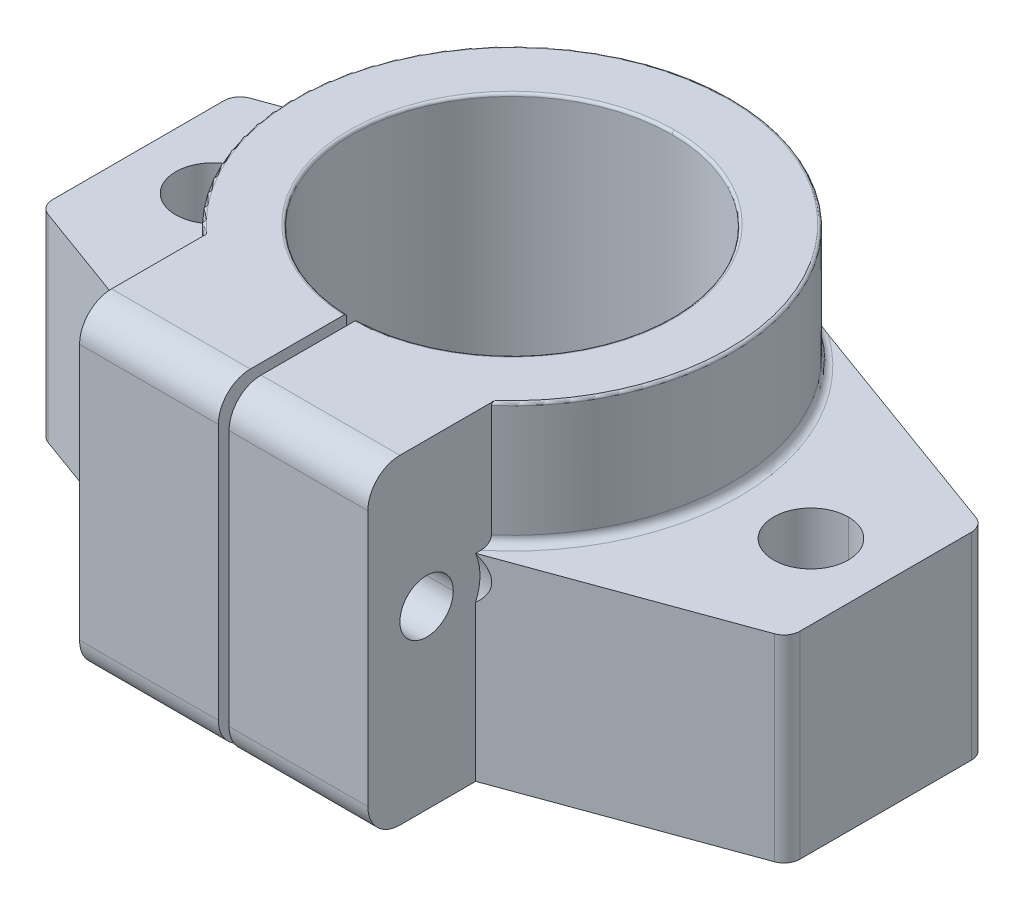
ISO-10303-21;
HEADER;
FILE_DESCRIPTION(('STEP AP214'),'2;1');
FILE_NAME('part.step','',(''),(''),'','','');
FILE_SCHEMA(('AUTOMOTIVE_DESIGN { 1 0 10303 214 1 1 1 1 }'));
ENDSEC;
DATA;
#1=APPLICATION_CONTEXT('core data for automotive mechanical design processes');
#2=APPLICATION_PROTOCOL_DEFINITION('international standard','automotive_design',2000,#1);
#3=PRODUCT_CONTEXT('',#1,'mechanical');
#4=PRODUCT('Part','Part','',(#3));
#5=PRODUCT_RELATED_PRODUCT_CATEGORY('part','',(#4));
#6=PRODUCT_DEFINITION_FORMATION('','',#4);
#7=PRODUCT_DEFINITION_CONTEXT('part definition',#1,'design');
#8=PRODUCT_DEFINITION('design','',#6,#7);
#9=PRODUCT_DEFINITION_SHAPE('','',#8);
#10=(LENGTH_UNIT() NAMED_UNIT(*) SI_UNIT(.MILLI.,.METRE.));
#11=(NAMED_UNIT(*) PLANE_ANGLE_UNIT() SI_UNIT($,.RADIAN.));
#12=(NAMED_UNIT(*) SI_UNIT($,.STERADIAN.) SOLID_ANGLE_UNIT());
#13=UNCERTAINTY_MEASURE_WITH_UNIT(LENGTH_MEASURE(1.E-05),#10,'distance_accuracy_value','');
#14=(GEOMETRIC_REPRESENTATION_CONTEXT(3) GLOBAL_UNCERTAINTY_ASSIGNED_CONTEXT((#13)) GLOBAL_UNIT_ASSIGNED_CONTEXT((#10,
#11,#12)) REPRESENTATION_CONTEXT('',''));
#15=CARTESIAN_POINT('',(0.,0.,0.));
#16=DIRECTION('',(0.,0.,1.));
#17=DIRECTION('',(1.,0.,0.));
#18=AXIS2_PLACEMENT_3D('',#15,#16,#17);
#19=CARTESIAN_POINT('',(0.,59.5,0.));
#20=DIRECTION('',(0.,-1.,0.));
#21=DIRECTION('',(0.,0.,-1.));
#22=AXIS2_PLACEMENT_3D('',#19,#20,#21);
#23=TOROIDAL_SURFACE('',#22,30.5,0.5);
#24=CARTESIAN_POINT('',(0.,59.5,-30.5));
#25=DIRECTION('',(-1.,0.,0.));
#26=DIRECTION('',(0.,0.,1.));
#27=AXIS2_PLACEMENT_3D('',#24,#25,#26);
#28=CIRCLE('',#27,0.5);
#29=CARTESIAN_POINT('',(0.,59.5,-30.));
#30=VERTEX_POINT('',#29);
#31=CARTESIAN_POINT('',(0.,60.,-30.5));
#32=VERTEX_POINT('',#31);
#33=EDGE_CURVE('E1103',#30,#32,#28,.T.);
#34=ORIENTED_EDGE('',*,*,#33,.F.);
#35=CARTESIAN_POINT('',(0.,59.5,0.));
#36=DIRECTION('',(0.,1.,0.));
#37=DIRECTION('',(0.,0.,-1.));
#38=AXIS2_PLACEMENT_3D('',#35,#36,#37);
#39=CIRCLE('',#38,30.);
#40=CARTESIAN_POINT('',(1.,59.5,29.9833287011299));
#41=VERTEX_POINT('',#40);
#42=EDGE_CURVE('E27',#41,#30,#39,.T.);
#43=ORIENTED_EDGE('',*,*,#42,.F.);
#44=CARTESIAN_POINT('',(1.,60.,30.4836021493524));
#45=CARTESIAN_POINT('',(1.,60.,30.385990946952));
#46=CARTESIAN_POINT('',(1.,59.9614255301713,30.2918975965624));
#47=CARTESIAN_POINT('',(1.,59.9243210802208,30.2013900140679));
#48=CARTESIAN_POINT('',(1.,59.8537276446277,30.1300307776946));
#49=CARTESIAN_POINT('',(1.,59.7862887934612,30.0618603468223));
#50=CARTESIAN_POINT('',(1.,59.691836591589,30.0220648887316));
#51=CARTESIAN_POINT('',(1.,59.5998985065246,29.9833287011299));
#52=CARTESIAN_POINT('',(1.,59.5,29.9833287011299));
#53=B_SPLINE_CURVE_WITH_KNOTS('',2,(#44,#45,#46,#47,#48,#49,#50,#51,#52),.UNSPECIFIED.,.F.,.F.,
(3,2,2,2,3),(0.,0.25,0.5,0.75,1.),.UNSPECIFIED.);
#54=CARTESIAN_POINT('',(1.,60.,30.4836021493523));
#55=VERTEX_POINT('',#54);
#56=EDGE_CURVE('E561',#55,#41,#53,.T.);
#57=ORIENTED_EDGE('',*,*,#56,.F.);
#58=CARTESIAN_POINT('',(0.,60.,0.));
#59=DIRECTION('',(0.,-1.,0.));
#60=DIRECTION('',(0.,0.,-1.));
#61=AXIS2_PLACEMENT_3D('',#58,#59,#60);
#62=CIRCLE('',#61,30.5);
#63=EDGE_CURVE('E861',#32,#55,#62,.T.);
#64=ORIENTED_EDGE('',*,*,#63,.F.);
#65=EDGE_LOOP('',(#34,#43,#57,#64));
#66=FACE_BOUND('',#65,.T.);
#67=ADVANCED_FACE('F16',(#66),#23,.T.);
#68=CARTESIAN_POINT('',(0.,0.5,0.));
#69=DIRECTION('',(0.,-1.,0.));
#70=DIRECTION('',(0.,0.,-1.));
#71=AXIS2_PLACEMENT_3D('',#68,#69,#70);
#72=TOROIDAL_SURFACE('',#71,30.5,0.5);
#73=CARTESIAN_POINT('',(0.,0.5,-30.5));
#74=DIRECTION('',(-1.,0.,0.));
#75=DIRECTION('',(0.,0.,1.));
#76=AXIS2_PLACEMENT_3D('',#73,#74,#75);
#77=CIRCLE('',#76,0.5);
#78=CARTESIAN_POINT('',(0.,0.,-30.5));
#79=VERTEX_POINT('',#78);
#80=CARTESIAN_POINT('',(0.,0.5,-30.));
#81=VERTEX_POINT('',#80);
#82=EDGE_CURVE('E1113',#79,#81,#77,.T.);
#83=ORIENTED_EDGE('',*,*,#82,.F.);
#84=CARTESIAN_POINT('',(0.,0.,0.));
#85=DIRECTION('',(0.,1.,0.));
#86=DIRECTION('',(0.,0.,-1.));
#87=AXIS2_PLACEMENT_3D('',#84,#85,#86);
#88=CIRCLE('',#87,30.5);
#89=CARTESIAN_POINT('',(1.,0.,30.4836021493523));
#90=VERTEX_POINT('',#89);
#91=EDGE_CURVE('E426',#90,#79,#88,.T.);
#92=ORIENTED_EDGE('',*,*,#91,.F.);
#93=CARTESIAN_POINT('',(1.,0.5,29.9833287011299));
#94=CARTESIAN_POINT('',(1.,0.402402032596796,29.9833287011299));
#95=CARTESIAN_POINT('',(1.,0.308313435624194,30.0219646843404));
#96=CARTESIAN_POINT('',(1.,0.217833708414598,30.0591187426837));
#97=CARTESIAN_POINT('',(1.,0.146525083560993,30.1297778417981));
#98=CARTESIAN_POINT('',(1.,0.0784225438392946,30.1972600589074));
#99=CARTESIAN_POINT('',(1.,0.0386776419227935,30.2917453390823));
#100=CARTESIAN_POINT('',(1.,0.,30.3836934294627));
#101=CARTESIAN_POINT('',(1.,0.,30.4836021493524));
#102=B_SPLINE_CURVE_WITH_KNOTS('',2,(#93,#94,#95,#96,#97,#98,#99,#100,#101),.UNSPECIFIED.,.F.,
.F.,(3,2,2,2,3),(0.,0.25,0.5,0.75,1.),.UNSPECIFIED.);
#103=CARTESIAN_POINT('',(1.,0.5,29.9833287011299));
#104=VERTEX_POINT('',#103);
#105=EDGE_CURVE('E922',#104,#90,#102,.T.);
#106=ORIENTED_EDGE('',*,*,#105,.F.);
#107=CARTESIAN_POINT('',(0.,0.5,0.));
#108=DIRECTION('',(0.,-1.,0.));
#109=DIRECTION('',(0.,0.,-1.));
#110=AXIS2_PLACEMENT_3D('',#107,#108,#109);
#111=CIRCLE('',#110,30.);
#112=EDGE_CURVE('E872',#81,#104,#111,.T.);
#113=ORIENTED_EDGE('',*,*,#112,.F.);
#114=EDGE_LOOP('',(#83,#92,#106,#113));
#115=FACE_BOUND('',#114,.T.);
#116=ADVANCED_FACE('F18',(#115),#72,.T.);
#117=CARTESIAN_POINT('',(0.,59.5,0.));
#118=DIRECTION('',(0.,-1.,0.));
#119=DIRECTION('',(0.,0.,-1.));
#120=AXIS2_PLACEMENT_3D('',#117,#118,#119);
#121=TOROIDAL_SURFACE('',#120,40.5,0.5);
#122=CARTESIAN_POINT('',(27.,59.5,30.854497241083));
#123=CARTESIAN_POINT('',(27.,59.6133403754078,30.854497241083));
#124=CARTESIAN_POINT('',(27.,59.717842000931,30.7880915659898));
#125=CARTESIAN_POINT('',(27.,59.808774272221,30.7303085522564));
#126=CARTESIAN_POINT('',(27.,59.8780684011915,30.6245132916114));
#127=CARTESIAN_POINT('',(27.,60.,30.4383534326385));
#128=CARTESIAN_POINT('',(27.,60.,30.1869176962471));
#129=B_SPLINE_CURVE_WITH_KNOTS('',2,(#122,#123,#124,#125,#126,#127,#128),.UNSPECIFIED.,.F.,.F.,
(3,2,2,3),(0.,0.25,0.5,1.),.UNSPECIFIED.);
#130=CARTESIAN_POINT('',(27.,59.5,30.854497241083));
#131=VERTEX_POINT('',#130);
#132=CARTESIAN_POINT('',(27.,60.,30.1869176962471));
#133=VERTEX_POINT('',#132);
#134=EDGE_CURVE('E386',#131,#133,#129,.T.);
#135=ORIENTED_EDGE('',*,*,#134,.F.);
#136=CARTESIAN_POINT('',(0.,59.5,0.));
#137=DIRECTION('',(0.,-1.,0.));
#138=DIRECTION('',(0.,0.,-1.));
#139=AXIS2_PLACEMENT_3D('',#136,#137,#138);
#140=CIRCLE('',#139,41.);
#141=CARTESIAN_POINT('',(0.,59.5,-41.));
#142=VERTEX_POINT('',#141);
#143=EDGE_CURVE('E604',#142,#131,#140,.T.);
#144=ORIENTED_EDGE('',*,*,#143,.F.);
#145=CARTESIAN_POINT('',(0.,59.5,-40.5));
#146=DIRECTION('',(1.,0.,0.));
#147=DIRECTION('',(0.,0.,-1.));
#148=AXIS2_PLACEMENT_3D('',#145,#146,#147);
#149=CIRCLE('',#148,0.5);
#150=CARTESIAN_POINT('',(0.,60.,-40.5));
#151=VERTEX_POINT('',#150);
#152=EDGE_CURVE('E10',#142,#151,#149,.T.);
#153=ORIENTED_EDGE('',*,*,#152,.T.);
#154=CARTESIAN_POINT('',(0.,60.,0.));
#155=DIRECTION('',(0.,1.,0.));
#156=DIRECTION('',(0.,0.,-1.));
#157=AXIS2_PLACEMENT_3D('',#154,#155,#156);
#158=CIRCLE('',#157,40.5);
#159=EDGE_CURVE('E784',#133,#151,#158,.T.);
#160=ORIENTED_EDGE('',*,*,#159,.F.);
#161=EDGE_LOOP('',(#135,#144,#153,#160));
#162=FACE_BOUND('',#161,.T.);
#163=ADVANCED_FACE('F719',(#162),#121,.T.);
#164=CARTESIAN_POINT('',(0.,59.5,0.));
#165=DIRECTION('',(0.,-1.,0.));
#166=DIRECTION('',(0.,0.,-1.));
#167=AXIS2_PLACEMENT_3D('',#164,#165,#166);
#168=TOROIDAL_SURFACE('',#167,40.5,0.5);
#169=CARTESIAN_POINT('',(-27.,60.,30.1869176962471));
#170=CARTESIAN_POINT('',(-27.,60.,30.4348096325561));
#171=CARTESIAN_POINT('',(-27.,59.8783266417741,30.6241151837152));
#172=CARTESIAN_POINT('',(-27.,59.8127448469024,30.7261506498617));
#173=CARTESIAN_POINT('',(-27.,59.7180650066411,30.7879479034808));
#174=CARTESIAN_POINT('',(-27.,59.6161044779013,30.854497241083));
#175=CARTESIAN_POINT('',(-27.,59.5,30.854497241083));
#176=B_SPLINE_CURVE_WITH_KNOTS('',2,(#169,#170,#171,#172,#173,#174,#175),.UNSPECIFIED.,.F.,.F.,
(3,2,2,3),(0.,0.5,0.75,1.),.UNSPECIFIED.);
#177=CARTESIAN_POINT('',(-27.,60.,30.1869176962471));
#178=VERTEX_POINT('',#177);
#179=CARTESIAN_POINT('',(-27.,59.5,30.8544972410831));
#180=VERTEX_POINT('',#179);
#181=EDGE_CURVE('E700',#178,#180,#176,.T.);
#182=ORIENTED_EDGE('',*,*,#181,.F.);
#183=CARTESIAN_POINT('',(0.,60.,0.));
#184=DIRECTION('',(0.,1.,0.));
#185=DIRECTION('',(0.,0.,-1.));
#186=AXIS2_PLACEMENT_3D('',#183,#184,#185);
#187=CIRCLE('',#186,40.5);
#188=EDGE_CURVE('E853',#151,#178,#187,.T.);
#189=ORIENTED_EDGE('',*,*,#188,.F.);
#190=ORIENTED_EDGE('',*,*,#152,.F.);
#191=CARTESIAN_POINT('',(0.,59.5,0.));
#192=DIRECTION('',(0.,-1.,0.));
#193=DIRECTION('',(0.,0.,-1.));
#194=AXIS2_PLACEMENT_3D('',#191,#192,#193);
#195=CIRCLE('',#194,41.);
#196=EDGE_CURVE('E868',#180,#142,#195,.T.);
#197=ORIENTED_EDGE('',*,*,#196,.F.);
#198=EDGE_LOOP('',(#182,#189,#190,#197));
#199=FACE_BOUND('',#198,.T.);
#200=ADVANCED_FACE('F845',(#199),#168,.T.);
#201=CARTESIAN_POINT('',(0.,-86.4084486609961,0.));
#202=DIRECTION('',(0.,1.,0.));
#203=DIRECTION('',(0.,0.,1.));
#204=AXIS2_PLACEMENT_3D('',#201,#202,#203);
#205=CYLINDRICAL_SURFACE('',#204,30.);
#206=DIRECTION('',(0.,-1.,0.));
#207=VECTOR('',#206,1.);
#208=CARTESIAN_POINT('',(-1.,-86.4084486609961,29.9833287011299));
#209=LINE('',#208,#207);
#210=CARTESIAN_POINT('',(-1.,59.5,29.9833287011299));
#211=VERTEX_POINT('',#210);
#212=CARTESIAN_POINT('',(-1.,0.5,29.9833287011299));
#213=VERTEX_POINT('',#212);
#214=EDGE_CURVE('E1144',#211,#213,#209,.T.);
#215=ORIENTED_EDGE('',*,*,#214,.T.);
#216=CARTESIAN_POINT('',(0.,0.5,0.));
#217=DIRECTION('',(0.,-1.,0.));
#218=DIRECTION('',(0.,0.,-1.));
#219=AXIS2_PLACEMENT_3D('',#216,#217,#218);
#220=CIRCLE('',#219,30.);
#221=EDGE_CURVE('E1117',#213,#81,#220,.T.);
#222=ORIENTED_EDGE('',*,*,#221,.T.);
#223=ORIENTED_EDGE('',*,*,#112,.T.);
#224=DIRECTION('',(0.,1.,0.));
#225=VECTOR('',#224,1.);
#226=CARTESIAN_POINT('',(1.,-86.4084486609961,29.9833287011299));
#227=LINE('',#226,#225);
#228=EDGE_CURVE('E648',#104,#41,#227,.T.);
#229=ORIENTED_EDGE('',*,*,#228,.T.);
#230=ORIENTED_EDGE('',*,*,#42,.T.);
#231=CARTESIAN_POINT('',(0.,59.5,0.));
#232=DIRECTION('',(0.,1.,0.));
#233=DIRECTION('',(0.,0.,-1.));
#234=AXIS2_PLACEMENT_3D('',#231,#232,#233);
#235=CIRCLE('',#234,30.);
#236=EDGE_CURVE('E1108',#30,#211,#235,.T.);
#237=ORIENTED_EDGE('',*,*,#236,.T.);
#238=EDGE_LOOP('',(#215,#222,#223,#229,#230,#237));
#239=FACE_BOUND('',#238,.T.);
#240=ADVANCED_FACE('F842',(#239),#205,.F.);
#241=CARTESIAN_POINT('',(70.,33.,43.));
#242=DIRECTION('',(-1.,0.,0.));
#243=DIRECTION('',(0.,0.,1.));
#244=AXIS2_PLACEMENT_3D('',#241,#242,#243);
#245=CYLINDRICAL_SURFACE('',#244,5.);
#246=CARTESIAN_POINT('',(-1.,33.,43.));
#247=DIRECTION('',(-1.,0.,0.));
#248=DIRECTION('',(0.,0.,1.));
#249=AXIS2_PLACEMENT_3D('',#246,#247,#248);
#250=CIRCLE('',#249,5.);
#251=CARTESIAN_POINT('',(-1.,33.,38.));
#252=VERTEX_POINT('',#251);
#253=CARTESIAN_POINT('',(-1.,33.,48.));
#254=VERTEX_POINT('',#253);
#255=EDGE_CURVE('E451',#252,#254,#250,.T.);
#256=ORIENTED_EDGE('',*,*,#255,.F.);
#257=DIRECTION('',(-1.,0.,0.));
#258=VECTOR('',#257,1.);
#259=CARTESIAN_POINT('',(70.,33.,38.));
#260=LINE('',#259,#258);
#261=CARTESIAN_POINT('',(-27.,33.,38.));
#262=VERTEX_POINT('',#261);
#263=EDGE_CURVE('E486',#252,#262,#260,.T.);
#264=ORIENTED_EDGE('',*,*,#263,.T.);
#265=CARTESIAN_POINT('',(-27.,33.,43.));
#266=DIRECTION('',(1.,0.,0.));
#267=DIRECTION('',(0.,0.,-1.));
#268=AXIS2_PLACEMENT_3D('',#265,#266,#267);
#269=CIRCLE('',#268,5.);
#270=CARTESIAN_POINT('',(-27.,33.,48.));
#271=VERTEX_POINT('',#270);
#272=EDGE_CURVE('E605',#271,#262,#269,.T.);
#273=ORIENTED_EDGE('',*,*,#272,.F.);
#274=DIRECTION('',(-1.,0.,0.));
#275=VECTOR('',#274,1.);
#276=CARTESIAN_POINT('',(70.,33.,48.));
#277=LINE('',#276,#275);
#278=EDGE_CURVE('E487',#254,#271,#277,.T.);
#279=ORIENTED_EDGE('',*,*,#278,.F.);
#280=EDGE_LOOP('',(#256,#264,#273,#279));
#281=FACE_BOUND('',#280,.T.);
#282=ADVANCED_FACE('F838',(#281),#245,.F.);
#283=CARTESIAN_POINT('',(70.,33.,43.));
#284=DIRECTION('',(-1.,0.,0.));
#285=DIRECTION('',(0.,0.,1.));
#286=AXIS2_PLACEMENT_3D('',#283,#284,#285);
#287=CYLINDRICAL_SURFACE('',#286,5.);
#288=CARTESIAN_POINT('',(27.,33.,43.));
#289=DIRECTION('',(-1.,0.,0.));
#290=DIRECTION('',(0.,0.,1.));
#291=AXIS2_PLACEMENT_3D('',#288,#289,#290);
#292=CIRCLE('',#291,5.);
#293=CARTESIAN_POINT('',(27.,33.,38.));
#294=VERTEX_POINT('',#293);
#295=CARTESIAN_POINT('',(27.,33.,48.));
#296=VERTEX_POINT('',#295);
#297=EDGE_CURVE('E391',#294,#296,#292,.T.);
#298=ORIENTED_EDGE('',*,*,#297,.F.);
#299=DIRECTION('',(-1.,0.,0.));
#300=VECTOR('',#299,1.);
#301=CARTESIAN_POINT('',(70.,33.,38.));
#302=LINE('',#301,#300);
#303=CARTESIAN_POINT('',(1.,33.,38.));
#304=VERTEX_POINT('',#303);
#305=EDGE_CURVE('E508',#294,#304,#302,.T.);
#306=ORIENTED_EDGE('',*,*,#305,.T.);
#307=CARTESIAN_POINT('',(1.,33.,43.));
#308=DIRECTION('',(1.,0.,0.));
#309=DIRECTION('',(0.,0.,-1.));
#310=AXIS2_PLACEMENT_3D('',#307,#308,#309);
#311=CIRCLE('',#310,5.);
#312=CARTESIAN_POINT('',(1.,33.,48.));
#313=VERTEX_POINT('',#312);
#314=EDGE_CURVE('E557',#313,#304,#311,.T.);
#315=ORIENTED_EDGE('',*,*,#314,.F.);
#316=DIRECTION('',(-1.,0.,0.));
#317=VECTOR('',#316,1.);
#318=CARTESIAN_POINT('',(70.,33.,48.));
#319=LINE('',#318,#317);
#320=EDGE_CURVE('E516',#296,#313,#319,.T.);
#321=ORIENTED_EDGE('',*,*,#320,.F.);
#322=EDGE_LOOP('',(#298,#306,#315,#321));
#323=FACE_BOUND('',#322,.T.);
#324=ADVANCED_FACE('F834',(#323),#287,.F.);
#325=CARTESIAN_POINT('',(0.,60.,0.));
#326=DIRECTION('',(0.,-1.,0.));
#327=DIRECTION('',(0.,0.,-1.));
#328=AXIS2_PLACEMENT_3D('',#325,#326,#327);
#329=CYLINDRICAL_SURFACE('',#328,41.);
#330=DIRECTION('',(0.,1.,0.));
#331=VECTOR('',#330,1.);
#332=CARTESIAN_POINT('',(-27.,37.,30.8544972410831));
#333=LINE('',#332,#331);
#334=CARTESIAN_POINT('',(-27.,38.5,30.8544972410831));
#335=VERTEX_POINT('',#334);
#336=EDGE_CURVE('E671',#335,#180,#333,.T.);
#337=ORIENTED_EDGE('',*,*,#336,.T.);
#338=ORIENTED_EDGE('',*,*,#196,.T.);
#339=DIRECTION('',(0.,-1.,0.));
#340=VECTOR('',#339,1.);
#341=CARTESIAN_POINT('',(0.,60.,-41.));
#342=LINE('',#341,#340);
#343=CARTESIAN_POINT('',(0.,0.,-41.));
#344=VERTEX_POINT('',#343);
#345=EDGE_CURVE('E600',#142,#344,#342,.T.);
#346=ORIENTED_EDGE('',*,*,#345,.T.);
#347=CARTESIAN_POINT('',(0.,0.,0.));
#348=DIRECTION('',(0.,1.,0.));
#349=DIRECTION('',(0.,0.,-1.));
#350=AXIS2_PLACEMENT_3D('',#347,#348,#349);
#351=CIRCLE('',#350,41.);
#352=CARTESIAN_POINT('',(-14.0228258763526,0.,-38.5273974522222));
#353=VERTEX_POINT('',#352);
#354=EDGE_CURVE('E596',#344,#353,#351,.T.);
#355=ORIENTED_EDGE('',*,*,#354,.T.);
#356=DIRECTION('',(0.,-1.,0.));
#357=VECTOR('',#356,1.);
#358=CARTESIAN_POINT('',(-14.0228258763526,60.,-38.5273974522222));
#359=LINE('',#358,#357);
#360=CARTESIAN_POINT('',(-14.0228258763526,38.5,-38.5273974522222));
#361=VERTEX_POINT('',#360);
#362=EDGE_CURVE('E694',#361,#353,#359,.T.);
#363=ORIENTED_EDGE('',*,*,#362,.F.);
#364=CARTESIAN_POINT('',(0.,38.5,0.));
#365=DIRECTION('',(0.,1.,0.));
#366=DIRECTION('',(0.,0.,1.));
#367=AXIS2_PLACEMENT_3D('',#364,#365,#366);
#368=CIRCLE('',#367,41.);
#369=EDGE_CURVE('E747',#361,#335,#368,.T.);
#370=ORIENTED_EDGE('',*,*,#369,.T.);
#371=EDGE_LOOP('',(#337,#338,#346,#355,#363,#370));
#372=FACE_BOUND('',#371,.T.);
#373=ADVANCED_FACE('F830',(#372),#329,.T.);
#374=CARTESIAN_POINT('',(56.,60.,0.));
#375=DIRECTION('',(0.,-1.,0.));
#376=DIRECTION('',(0.,0.,-1.));
#377=AXIS2_PLACEMENT_3D('',#374,#375,#376);
#378=CYLINDRICAL_SURFACE('',#377,7.);
#379=CARTESIAN_POINT('',(56.,37.,0.));
#380=DIRECTION('',(0.,1.,0.));
#381=DIRECTION('',(0.,0.,1.));
#382=AXIS2_PLACEMENT_3D('',#379,#380,#381);
#383=CIRCLE('',#382,7.);
#384=CARTESIAN_POINT('',(56.,37.,-7.));
#385=VERTEX_POINT('',#384);
#386=CARTESIAN_POINT('',(56.,37.,7.));
#387=VERTEX_POINT('',#386);
#388=EDGE_CURVE('E617',#385,#387,#383,.T.);
#389=ORIENTED_EDGE('',*,*,#388,.T.);
#390=DIRECTION('',(0.,-1.,0.));
#391=VECTOR('',#390,1.);
#392=CARTESIAN_POINT('',(56.,60.,7.));
#393=LINE('',#392,#391);
#394=CARTESIAN_POINT('',(56.,0.,7.));
#395=VERTEX_POINT('',#394);
#396=EDGE_CURVE('E421',#387,#395,#393,.T.);
#397=ORIENTED_EDGE('',*,*,#396,.T.);
#398=CARTESIAN_POINT('',(56.,0.,0.));
#399=DIRECTION('',(0.,1.,0.));
#400=DIRECTION('',(0.,0.,-1.));
#401=AXIS2_PLACEMENT_3D('',#398,#399,#400);
#402=CIRCLE('',#401,7.);
#403=CARTESIAN_POINT('',(56.,0.,-7.));
#404=VERTEX_POINT('',#403);
#405=EDGE_CURVE('E678',#404,#395,#402,.T.);
#406=ORIENTED_EDGE('',*,*,#405,.F.);
#407=DIRECTION('',(0.,-1.,0.));
#408=VECTOR('',#407,1.);
#409=CARTESIAN_POINT('',(56.,60.,-7.));
#410=LINE('',#409,#408);
#411=EDGE_CURVE('E418',#385,#404,#410,.T.);
#412=ORIENTED_EDGE('',*,*,#411,.F.);
#413=EDGE_LOOP('',(#389,#397,#406,#412));
#414=FACE_BOUND('',#413,.T.);
#415=ADVANCED_FACE('F827',(#414),#378,.F.);
#416=CARTESIAN_POINT('',(-56.,60.,0.));
#417=DIRECTION('',(0.,-1.,0.));
#418=DIRECTION('',(0.,0.,-1.));
#419=AXIS2_PLACEMENT_3D('',#416,#417,#418);
#420=CYLINDRICAL_SURFACE('',#419,7.);
#421=CARTESIAN_POINT('',(-56.,37.,0.));
#422=DIRECTION('',(0.,1.,0.));
#423=DIRECTION('',(0.,0.,1.));
#424=AXIS2_PLACEMENT_3D('',#421,#422,#423);
#425=CIRCLE('',#424,7.);
#426=CARTESIAN_POINT('',(-56.,37.,-7.));
#427=VERTEX_POINT('',#426);
#428=CARTESIAN_POINT('',(-56.,37.,7.));
#429=VERTEX_POINT('',#428);
#430=EDGE_CURVE('E504',#427,#429,#425,.T.);
#431=ORIENTED_EDGE('',*,*,#430,.T.);
#432=DIRECTION('',(0.,-1.,0.));
#433=VECTOR('',#432,1.);
#434=CARTESIAN_POINT('',(-56.,60.,7.));
#435=LINE('',#434,#433);
#436=CARTESIAN_POINT('',(-56.,0.,7.));
#437=VERTEX_POINT('',#436);
#438=EDGE_CURVE('E50',#429,#437,#435,.T.);
#439=ORIENTED_EDGE('',*,*,#438,.T.);
#440=CARTESIAN_POINT('',(-56.,0.,0.));
#441=DIRECTION('',(0.,1.,0.));
#442=DIRECTION('',(0.,0.,1.));
#443=AXIS2_PLACEMENT_3D('',#440,#441,#442);
#444=CIRCLE('',#443,7.);
#445=CARTESIAN_POINT('',(-56.,0.,-7.));
#446=VERTEX_POINT('',#445);
#447=EDGE_CURVE('E660',#446,#437,#444,.T.);
#448=ORIENTED_EDGE('',*,*,#447,.F.);
#449=DIRECTION('',(0.,-1.,0.));
#450=VECTOR('',#449,1.);
#451=CARTESIAN_POINT('',(-56.,60.,-7.));
#452=LINE('',#451,#450);
#453=EDGE_CURVE('E691',#427,#446,#452,.T.);
#454=ORIENTED_EDGE('',*,*,#453,.F.);
#455=EDGE_LOOP('',(#431,#439,#448,#454));
#456=FACE_BOUND('',#455,.T.);
#457=ADVANCED_FACE('F814',(#456),#420,.F.);
#458=CARTESIAN_POINT('',(0.,60.,0.));
#459=DIRECTION('',(0.,-1.,0.));
#460=DIRECTION('',(0.,0.,-1.));
#461=AXIS2_PLACEMENT_3D('',#458,#459,#460);
#462=PLANE('',#461);
#463=DIRECTION('',(0.,0.,-1.));
#464=VECTOR('',#463,1.);
#465=CARTESIAN_POINT('',(27.,60.,54.));
#466=LINE('',#465,#464);
#467=CARTESIAN_POINT('',(27.,60.,48.));
#468=VERTEX_POINT('',#467);
#469=EDGE_CURVE('E378',#468,#133,#466,.T.);
#470=ORIENTED_EDGE('',*,*,#469,.T.);
#471=ORIENTED_EDGE('',*,*,#159,.T.);
#472=ORIENTED_EDGE('',*,*,#188,.T.);
#473=DIRECTION('',(0.,0.,1.));
#474=VECTOR('',#473,1.);
#475=CARTESIAN_POINT('',(-27.,60.,54.));
#476=LINE('',#475,#474);
#477=CARTESIAN_POINT('',(-27.,60.,48.));
#478=VERTEX_POINT('',#477);
#479=EDGE_CURVE('E663',#178,#478,#476,.T.);
#480=ORIENTED_EDGE('',*,*,#479,.T.);
#481=DIRECTION('',(1.,0.,0.));
#482=VECTOR('',#481,1.);
#483=CARTESIAN_POINT('',(0.,60.,48.));
#484=LINE('',#483,#482);
#485=CARTESIAN_POINT('',(-1.,60.,48.));
#486=VERTEX_POINT('',#485);
#487=EDGE_CURVE('E1087',#478,#486,#484,.T.);
#488=ORIENTED_EDGE('',*,*,#487,.T.);
#489=DIRECTION('',(0.,0.,-1.));
#490=VECTOR('',#489,1.);
#491=CARTESIAN_POINT('',(-1.,60.,30.2334665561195));
#492=LINE('',#491,#490);
#493=CARTESIAN_POINT('',(-1.,60.,30.4836021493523));
#494=VERTEX_POINT('',#493);
#495=EDGE_CURVE('E654',#486,#494,#492,.T.);
#496=ORIENTED_EDGE('',*,*,#495,.T.);
#497=CARTESIAN_POINT('',(0.,60.,0.));
#498=DIRECTION('',(0.,-1.,0.));
#499=DIRECTION('',(0.,0.,-1.));
#500=AXIS2_PLACEMENT_3D('',#497,#498,#499);
#501=CIRCLE('',#500,30.5);
#502=EDGE_CURVE('E1107',#494,#32,#501,.T.);
#503=ORIENTED_EDGE('',*,*,#502,.T.);
#504=ORIENTED_EDGE('',*,*,#63,.T.);
#505=DIRECTION('',(0.,0.,1.));
#506=VECTOR('',#505,1.);
#507=CARTESIAN_POINT('',(1.,60.,30.2334665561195));
#508=LINE('',#507,#506);
#509=CARTESIAN_POINT('',(1.,60.,48.));
#510=VERTEX_POINT('',#509);
#511=EDGE_CURVE('E397',#55,#510,#508,.T.);
#512=ORIENTED_EDGE('',*,*,#511,.T.);
#513=DIRECTION('',(1.,0.,0.));
#514=VECTOR('',#513,1.);
#515=CARTESIAN_POINT('',(0.,60.,48.));
#516=LINE('',#515,#514);
#517=EDGE_CURVE('E394',#510,#468,#516,.T.);
#518=ORIENTED_EDGE('',*,*,#517,.T.);
#519=EDGE_LOOP('',(#470,#471,#472,#480,#488,#496,#503,#504,#512,#518));
#520=FACE_BOUND('',#519,.T.);
#521=ADVANCED_FACE('F395',(#520),#462,.F.);
#522=CARTESIAN_POINT('',(-14.0228258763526,60.,-38.5273974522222));
#523=DIRECTION('',(0.342020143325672,0.,0.939692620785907));
#524=DIRECTION('',(0.,-1.,0.));
#525=AXIS2_PLACEMENT_3D('',#522,#523,#524);
#526=PLANE('',#525);
#527=DIRECTION('',(-0.939692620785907,0.,0.342020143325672));
#528=VECTOR('',#527,1.);
#529=CARTESIAN_POINT('',(-14.0228258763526,0.,-38.5273974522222));
#530=LINE('',#529,#528);
#531=CARTESIAN_POINT('',(-68.026060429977,0.,-18.8718275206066));
#532=VERTEX_POINT('',#531);
#533=EDGE_CURVE('E630',#353,#532,#530,.T.);
#534=ORIENTED_EDGE('',*,*,#533,.T.);
#535=DIRECTION('',(0.,1.,0.));
#536=VECTOR('',#535,1.);
#537=CARTESIAN_POINT('',(-68.026060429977,60.,-18.8718275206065));
#538=LINE('',#537,#536);
#539=CARTESIAN_POINT('',(-68.026060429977,37.,-18.8718275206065));
#540=VERTEX_POINT('',#539);
#541=EDGE_CURVE('E537',#532,#540,#538,.T.);
#542=ORIENTED_EDGE('',*,*,#541,.T.);
#543=DIRECTION('',(-0.939692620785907,0.,0.342020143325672));
#544=VECTOR('',#543,1.);
#545=CARTESIAN_POINT('',(-14.0228258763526,37.,-38.5273974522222));
#546=LINE('',#545,#544);
#547=CARTESIAN_POINT('',(-24.5394096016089,37.,-34.6996740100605));
#548=VERTEX_POINT('',#547);
#549=EDGE_CURVE('E772',#548,#540,#546,.T.);
#550=ORIENTED_EDGE('',*,*,#549,.F.);
#551=CARTESIAN_POINT('',(-24.5394096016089,37.,-34.6996740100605));
#552=CARTESIAN_POINT('',(-23.3437904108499,37.,-35.1348438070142));
#553=CARTESIAN_POINT('',(-21.8861230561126,37.1504576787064,-35.6653913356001));
#554=CARTESIAN_POINT('',(-20.6891069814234,37.2740114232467,-36.1010695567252));
#555=CARTESIAN_POINT('',(-19.2508087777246,37.5069951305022,-36.6245672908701));
#556=CARTESIAN_POINT('',(-18.0895826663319,37.6950971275,-37.0472190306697));
#557=CARTESIAN_POINT('',(-16.6330342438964,37.9770066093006,-37.5773593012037));
#558=CARTESIAN_POINT('',(-15.8022778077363,38.1377964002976,-37.879729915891));
#559=CARTESIAN_POINT('',(-14.0228258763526,38.5,-38.5273974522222));
#560=B_SPLINE_CURVE_WITH_KNOTS('',2,(#551,#552,#553,#554,#555,#556,#557,#558,#559),
.UNSPECIFIED.,.F.,.F.,(3,2,2,2,3),(0.,0.25,0.5,0.75,1.),.UNSPECIFIED.);
#561=EDGE_CURVE('E1353',#548,#361,#560,.T.);
#562=ORIENTED_EDGE('',*,*,#561,.T.);
#563=ORIENTED_EDGE('',*,*,#362,.T.);
#564=EDGE_LOOP('',(#534,#542,#550,#562,#563));
#565=FACE_BOUND('',#564,.T.);
#566=ADVANCED_FACE('F813',(#565),#526,.F.);
#567=CARTESIAN_POINT('',(-70.,60.,-18.1533722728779));
#568=DIRECTION('',(1.,0.,0.));
#569=DIRECTION('',(0.,1.,0.));
#570=AXIS2_PLACEMENT_3D('',#567,#568,#569);
#571=PLANE('',#570);
#572=DIRECTION('',(0.,0.,1.));
#573=VECTOR('',#572,1.);
#574=CARTESIAN_POINT('',(-70.,37.,-18.1533722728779));
#575=LINE('',#574,#573);
#576=CARTESIAN_POINT('',(-70.,37.,-16.0527496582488));
#577=VERTEX_POINT('',#576);
#578=CARTESIAN_POINT('',(-70.,37.,16.0527496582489));
#579=VERTEX_POINT('',#578);
#580=EDGE_CURVE('E611',#577,#579,#575,.T.);
#581=ORIENTED_EDGE('',*,*,#580,.F.);
#582=DIRECTION('',(0.,-1.,0.));
#583=VECTOR('',#582,1.);
#584=CARTESIAN_POINT('',(-70.,60.,-16.0527496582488));
#585=LINE('',#584,#583);
#586=CARTESIAN_POINT('',(-70.,0.,-16.0527496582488));
#587=VERTEX_POINT('',#586);
#588=EDGE_CURVE('E556',#577,#587,#585,.T.);
#589=ORIENTED_EDGE('',*,*,#588,.T.);
#590=DIRECTION('',(0.,0.,1.));
#591=VECTOR('',#590,1.);
#592=CARTESIAN_POINT('',(-70.,0.,-18.1533722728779));
#593=LINE('',#592,#591);
#594=CARTESIAN_POINT('',(-70.,0.,16.0527496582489));
#595=VERTEX_POINT('',#594);
#596=EDGE_CURVE('E549',#587,#595,#593,.T.);
#597=ORIENTED_EDGE('',*,*,#596,.T.);
#598=DIRECTION('',(0.,1.,0.));
#599=VECTOR('',#598,1.);
#600=CARTESIAN_POINT('',(-70.,60.,16.0527496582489));
#601=LINE('',#600,#599);
#602=EDGE_CURVE('E457',#595,#579,#601,.T.);
#603=ORIENTED_EDGE('',*,*,#602,.T.);
#604=EDGE_LOOP('',(#581,#589,#597,#603));
#605=FACE_BOUND('',#604,.T.);
#606=ADVANCED_FACE('F822',(#605),#571,.F.);
#607=CARTESIAN_POINT('',(-70.,60.,18.153372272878));
#608=DIRECTION('',(0.342020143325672,0.,-0.939692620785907));
#609=DIRECTION('',(0.,-1.,0.));
#610=AXIS2_PLACEMENT_3D('',#607,#608,#609);
#611=PLANE('',#610);
#612=DIRECTION('',(0.939692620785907,0.,0.342020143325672));
#613=VECTOR('',#612,1.);
#614=CARTESIAN_POINT('',(-70.,37.,18.153372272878));
#615=LINE('',#614,#613);
#616=CARTESIAN_POINT('',(-68.026060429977,37.,18.8718275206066));
#617=VERTEX_POINT('',#616);
#618=CARTESIAN_POINT('',(-27.,37.,33.8040923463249));
#619=VERTEX_POINT('',#618);
#620=EDGE_CURVE('E606',#617,#619,#615,.T.);
#621=ORIENTED_EDGE('',*,*,#620,.F.);
#622=DIRECTION('',(0.,-1.,0.));
#623=VECTOR('',#622,1.);
#624=CARTESIAN_POINT('',(-68.026060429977,60.,18.8718275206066));
#625=LINE('',#624,#623);
#626=CARTESIAN_POINT('',(-68.026060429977,0.,18.8718275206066));
#627=VERTEX_POINT('',#626);
#628=EDGE_CURVE('E456',#617,#627,#625,.T.);
#629=ORIENTED_EDGE('',*,*,#628,.T.);
#630=DIRECTION('',(0.939692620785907,0.,0.342020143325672));
#631=VECTOR('',#630,1.);
#632=CARTESIAN_POINT('',(-70.,0.,18.153372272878));
#633=LINE('',#632,#631);
#634=CARTESIAN_POINT('',(-27.,0.,33.8040923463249));
#635=VERTEX_POINT('',#634);
#636=EDGE_CURVE('E546',#627,#635,#633,.T.);
#637=ORIENTED_EDGE('',*,*,#636,.T.);
#638=DIRECTION('',(0.,-1.,0.));
#639=VECTOR('',#638,1.);
#640=CARTESIAN_POINT('',(-27.,60.,33.8040923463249));
#641=LINE('',#640,#639);
#642=EDGE_CURVE('E667',#619,#635,#641,.T.);
#643=ORIENTED_EDGE('',*,*,#642,.F.);
#644=EDGE_LOOP('',(#621,#629,#637,#643));
#645=FACE_BOUND('',#644,.T.);
#646=ADVANCED_FACE('F819',(#645),#611,.F.);
#647=CARTESIAN_POINT('',(70.,60.,18.1533722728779));
#648=DIRECTION('',(-0.342020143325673,0.,-0.939692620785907));
#649=DIRECTION('',(-0.939692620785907,0.,0.342020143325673));
#650=AXIS2_PLACEMENT_3D('',#647,#648,#649);
#651=PLANE('',#650);
#652=CARTESIAN_POINT('',(27.,29.0712238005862,33.8040923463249));
#653=CARTESIAN_POINT('',(29.9873461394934,31.6162293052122,32.7167872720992));
#654=CARTESIAN_POINT('',(29.9873461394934,34.3837706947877,32.7167872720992));
#655=CARTESIAN_POINT('',(27.,36.9287761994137,33.8040923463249));
#656=(BOUNDED_CURVE() B_SPLINE_CURVE(3,(#652,#653,#654,#655),.UNSPECIFIED.,.F.,
.F.) B_SPLINE_CURVE_WITH_KNOTS((4,4),(2.73783390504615,3.54535140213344),
.UNSPECIFIED.) CURVE() GEOMETRIC_REPRESENTATION_ITEM() RATIONAL_B_SPLINE_CURVE((1.,
0.94639384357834,0.94639384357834,1.)) REPRESENTATION_ITEM(''));
#657=CARTESIAN_POINT('',(27.,29.0712238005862,33.8040923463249));
#658=VERTEX_POINT('',#657);
#659=CARTESIAN_POINT('',(27.,36.9287761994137,33.8040923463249));
#660=VERTEX_POINT('',#659);
#661=EDGE_CURVE('E466',#658,#660,#656,.T.);
#662=ORIENTED_EDGE('',*,*,#661,.F.);
#663=DIRECTION('',(0.,-1.,0.));
#664=VECTOR('',#663,1.);
#665=CARTESIAN_POINT('',(27.,60.,33.8040923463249));
#666=LINE('',#665,#664);
#667=CARTESIAN_POINT('',(27.,0.,33.8040923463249));
#668=VERTEX_POINT('',#667);
#669=EDGE_CURVE('E635',#658,#668,#666,.T.);
#670=ORIENTED_EDGE('',*,*,#669,.T.);
#671=DIRECTION('',(0.939692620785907,0.,-0.342020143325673));
#672=VECTOR('',#671,1.);
#673=CARTESIAN_POINT('',(70.,0.,18.1533722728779));
#674=LINE('',#673,#672);
#675=CARTESIAN_POINT('',(68.026060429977,0.,18.8718275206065));
#676=VERTEX_POINT('',#675);
#677=EDGE_CURVE('E666',#668,#676,#674,.T.);
#678=ORIENTED_EDGE('',*,*,#677,.T.);
#679=DIRECTION('',(0.,1.,0.));
#680=VECTOR('',#679,1.);
#681=CARTESIAN_POINT('',(68.026060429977,60.,18.8718275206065));
#682=LINE('',#681,#680);
#683=CARTESIAN_POINT('',(68.026060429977,37.,18.8718275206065));
#684=VERTEX_POINT('',#683);
#685=EDGE_CURVE('E530',#676,#684,#682,.T.);
#686=ORIENTED_EDGE('',*,*,#685,.T.);
#687=DIRECTION('',(0.939692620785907,0.,-0.342020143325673));
#688=VECTOR('',#687,1.);
#689=CARTESIAN_POINT('',(70.,37.,18.1533722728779));
#690=LINE('',#689,#688);
#691=CARTESIAN_POINT('',(27.,37.,33.8040923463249));
#692=VERTEX_POINT('',#691);
#693=EDGE_CURVE('E614',#692,#684,#690,.T.);
#694=ORIENTED_EDGE('',*,*,#693,.F.);
#695=DIRECTION('',(0.,-1.,0.));
#696=VECTOR('',#695,1.);
#697=CARTESIAN_POINT('',(27.,60.,33.8040923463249));
#698=LINE('',#697,#696);
#699=EDGE_CURVE('E639',#692,#660,#698,.T.);
#700=ORIENTED_EDGE('',*,*,#699,.T.);
#701=EDGE_LOOP('',(#662,#670,#678,#686,#694,#700));
#702=FACE_BOUND('',#701,.T.);
#703=ADVANCED_FACE('F817',(#702),#651,.F.);
#704=CARTESIAN_POINT('',(70.,60.,-18.1533722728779));
#705=DIRECTION('',(-1.,0.,0.));
#706=DIRECTION('',(0.,0.,1.));
#707=AXIS2_PLACEMENT_3D('',#704,#705,#706);
#708=PLANE('',#707);
#709=DIRECTION('',(0.,0.,-1.));
#710=VECTOR('',#709,1.);
#711=CARTESIAN_POINT('',(70.,0.,-18.1533722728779));
#712=LINE('',#711,#710);
#713=CARTESIAN_POINT('',(70.,0.,16.0527496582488));
#714=VERTEX_POINT('',#713);
#715=CARTESIAN_POINT('',(70.,0.,-16.0527496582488));
#716=VERTEX_POINT('',#715);
#717=EDGE_CURVE('E595',#714,#716,#712,.T.);
#718=ORIENTED_EDGE('',*,*,#717,.T.);
#719=DIRECTION('',(0.,1.,0.));
#720=VECTOR('',#719,1.);
#721=CARTESIAN_POINT('',(70.,60.,-16.0527496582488));
#722=LINE('',#721,#720);
#723=CARTESIAN_POINT('',(70.,37.,-16.0527496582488));
#724=VERTEX_POINT('',#723);
#725=EDGE_CURVE('E588',#716,#724,#722,.T.);
#726=ORIENTED_EDGE('',*,*,#725,.T.);
#727=DIRECTION('',(0.,0.,-1.));
#728=VECTOR('',#727,1.);
#729=CARTESIAN_POINT('',(70.,37.,-18.1533722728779));
#730=LINE('',#729,#728);
#731=CARTESIAN_POINT('',(70.,37.,16.0527496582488));
#732=VERTEX_POINT('',#731);
#733=EDGE_CURVE('E503',#732,#724,#730,.T.);
#734=ORIENTED_EDGE('',*,*,#733,.F.);
#735=DIRECTION('',(0.,-1.,0.));
#736=VECTOR('',#735,1.);
#737=CARTESIAN_POINT('',(70.,60.,16.0527496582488));
#738=LINE('',#737,#736);
#739=EDGE_CURVE('E529',#732,#714,#738,.T.);
#740=ORIENTED_EDGE('',*,*,#739,.T.);
#741=EDGE_LOOP('',(#718,#726,#734,#740));
#742=FACE_BOUND('',#741,.T.);
#743=ADVANCED_FACE('F809',(#742),#708,.F.);
#744=CARTESIAN_POINT('',(14.0228258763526,60.,-38.5273974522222));
#745=DIRECTION('',(-0.342020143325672,0.,0.939692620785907));
#746=DIRECTION('',(0.,1.,0.));
#747=AXIS2_PLACEMENT_3D('',#744,#745,#746);
#748=PLANE('',#747);
#749=DIRECTION('',(-0.939692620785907,0.,-0.342020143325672));
#750=VECTOR('',#749,1.);
#751=CARTESIAN_POINT('',(14.0228258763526,37.,-38.5273974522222));
#752=LINE('',#751,#750);
#753=CARTESIAN_POINT('',(68.026060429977,37.,-18.8718275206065));
#754=VERTEX_POINT('',#753);
#755=CARTESIAN_POINT('',(24.5394096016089,37.,-34.6996740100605));
#756=VERTEX_POINT('',#755);
#757=EDGE_CURVE('E584',#754,#756,#752,.T.);
#758=ORIENTED_EDGE('',*,*,#757,.F.);
#759=DIRECTION('',(0.,-1.,0.));
#760=VECTOR('',#759,1.);
#761=CARTESIAN_POINT('',(68.026060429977,60.,-18.8718275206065));
#762=LINE('',#761,#760);
#763=CARTESIAN_POINT('',(68.026060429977,0.,-18.8718275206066));
#764=VERTEX_POINT('',#763);
#765=EDGE_CURVE('E569',#754,#764,#762,.T.);
#766=ORIENTED_EDGE('',*,*,#765,.T.);
#767=DIRECTION('',(-0.939692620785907,0.,-0.342020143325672));
#768=VECTOR('',#767,1.);
#769=CARTESIAN_POINT('',(14.0228258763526,0.,-38.5273974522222));
#770=LINE('',#769,#768);
#771=CARTESIAN_POINT('',(14.0228258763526,0.,-38.5273974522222));
#772=VERTEX_POINT('',#771);
#773=EDGE_CURVE('E592',#764,#772,#770,.T.);
#774=ORIENTED_EDGE('',*,*,#773,.T.);
#775=DIRECTION('',(0.,-1.,0.));
#776=VECTOR('',#775,1.);
#777=CARTESIAN_POINT('',(14.0228258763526,60.,-38.5273974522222));
#778=LINE('',#777,#776);
#779=CARTESIAN_POINT('',(14.0228258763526,38.5,-38.5273974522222));
#780=VERTEX_POINT('',#779);
#781=EDGE_CURVE('E427',#780,#772,#778,.T.);
#782=ORIENTED_EDGE('',*,*,#781,.F.);
#783=CARTESIAN_POINT('',(14.0228258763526,38.5,-38.5273974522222));
#784=CARTESIAN_POINT('',(15.8000314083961,38.1382536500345,-37.8805475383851));
#785=CARTESIAN_POINT('',(16.6325191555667,37.977111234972,-37.5775467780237));
#786=CARTESIAN_POINT('',(18.0875616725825,37.6954625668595,-37.0479546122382));
#787=CARTESIAN_POINT('',(19.2507941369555,37.5069975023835,-36.6245726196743));
#788=CARTESIAN_POINT('',(20.6871502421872,37.2742813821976,-36.1017817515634));
#789=CARTESIAN_POINT('',(21.8861156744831,37.1504584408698,-35.6653940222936));
#790=CARTESIAN_POINT('',(23.3429900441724,37.,-35.1351351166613));
#791=CARTESIAN_POINT('',(24.5394096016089,37.,-34.6996740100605));
#792=B_SPLINE_CURVE_WITH_KNOTS('',2,(#783,#784,#785,#786,#787,#788,#789,#790,#791),
.UNSPECIFIED.,.F.,.F.,(3,2,2,2,3),(0.,0.25,0.5,0.75,1.),.UNSPECIFIED.);
#793=EDGE_CURVE('E791',#780,#756,#792,.T.);
#794=ORIENTED_EDGE('',*,*,#793,.T.);
#795=EDGE_LOOP('',(#758,#766,#774,#782,#794));
#796=FACE_BOUND('',#795,.T.);
#797=ADVANCED_FACE('F798',(#796),#748,.F.);
#798=CARTESIAN_POINT('',(-56.,60.,0.));
#799=DIRECTION('',(0.,-1.,0.));
#800=DIRECTION('',(0.,0.,-1.));
#801=AXIS2_PLACEMENT_3D('',#798,#799,#800);
#802=CYLINDRICAL_SURFACE('',#801,7.);
#803=ORIENTED_EDGE('',*,*,#438,.F.);
#804=CARTESIAN_POINT('',(-56.,37.,0.));
#805=DIRECTION('',(0.,1.,0.));
#806=DIRECTION('',(0.,0.,1.));
#807=AXIS2_PLACEMENT_3D('',#804,#805,#806);
#808=CIRCLE('',#807,7.);
#809=EDGE_CURVE('E499',#429,#427,#808,.T.);
#810=ORIENTED_EDGE('',*,*,#809,.T.);
#811=ORIENTED_EDGE('',*,*,#453,.T.);
#812=CARTESIAN_POINT('',(-56.,0.,0.));
#813=DIRECTION('',(0.,1.,0.));
#814=DIRECTION('',(0.,0.,1.));
#815=AXIS2_PLACEMENT_3D('',#812,#813,#814);
#816=CIRCLE('',#815,7.);
#817=EDGE_CURVE('E446',#437,#446,#816,.T.);
#818=ORIENTED_EDGE('',*,*,#817,.F.);
#819=EDGE_LOOP('',(#803,#810,#811,#818));
#820=FACE_BOUND('',#819,.T.);
#821=ADVANCED_FACE('F808',(#820),#802,.F.);
#822=CARTESIAN_POINT('',(56.,60.,0.));
#823=DIRECTION('',(0.,-1.,0.));
#824=DIRECTION('',(0.,0.,-1.));
#825=AXIS2_PLACEMENT_3D('',#822,#823,#824);
#826=CYLINDRICAL_SURFACE('',#825,7.);
#827=ORIENTED_EDGE('',*,*,#396,.F.);
#828=CARTESIAN_POINT('',(56.,37.,0.));
#829=DIRECTION('',(0.,1.,0.));
#830=DIRECTION('',(0.,0.,1.));
#831=AXIS2_PLACEMENT_3D('',#828,#829,#830);
#832=CIRCLE('',#831,7.);
#833=EDGE_CURVE('E622',#387,#385,#832,.T.);
#834=ORIENTED_EDGE('',*,*,#833,.T.);
#835=ORIENTED_EDGE('',*,*,#411,.T.);
#836=CARTESIAN_POINT('',(56.,0.,0.));
#837=DIRECTION('',(0.,1.,0.));
#838=DIRECTION('',(0.,0.,-1.));
#839=AXIS2_PLACEMENT_3D('',#836,#837,#838);
#840=CIRCLE('',#839,7.);
#841=EDGE_CURVE('E682',#395,#404,#840,.T.);
#842=ORIENTED_EDGE('',*,*,#841,.F.);
#843=EDGE_LOOP('',(#827,#834,#835,#842));
#844=FACE_BOUND('',#843,.T.);
#845=ADVANCED_FACE('F2136',(#844),#826,.F.);
#846=CARTESIAN_POINT('',(0.,0.,0.));
#847=DIRECTION('',(0.,-1.,0.));
#848=DIRECTION('',(0.,0.,-1.));
#849=AXIS2_PLACEMENT_3D('',#846,#847,#848);
#850=PLANE('',#849);
#851=ORIENTED_EDGE('',*,*,#447,.T.);
#852=ORIENTED_EDGE('',*,*,#817,.T.);
#853=EDGE_LOOP('',(#851,#852));
#854=FACE_BOUND('',#853,.T.);
#855=ORIENTED_EDGE('',*,*,#405,.T.);
#856=ORIENTED_EDGE('',*,*,#841,.T.);
#857=EDGE_LOOP('',(#855,#856));
#858=FACE_BOUND('',#857,.T.);
#859=DIRECTION('',(0.,0.,1.));
#860=VECTOR('',#859,1.);
#861=CARTESIAN_POINT('',(1.,0.,30.2334665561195));
#862=LINE('',#861,#860);
#863=CARTESIAN_POINT('',(1.,0.,48.));
#864=VERTEX_POINT('',#863);
#865=EDGE_CURVE('E939',#90,#864,#862,.T.);
#866=ORIENTED_EDGE('',*,*,#865,.F.);
#867=ORIENTED_EDGE('',*,*,#91,.T.);
#868=CARTESIAN_POINT('',(0.,0.,0.));
#869=DIRECTION('',(0.,1.,0.));
#870=DIRECTION('',(0.,0.,-1.));
#871=AXIS2_PLACEMENT_3D('',#868,#869,#870);
#872=CIRCLE('',#871,30.5);
#873=CARTESIAN_POINT('',(-1.,0.,30.4836021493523));
#874=VERTEX_POINT('',#873);
#875=EDGE_CURVE('E1118',#79,#874,#872,.T.);
#876=ORIENTED_EDGE('',*,*,#875,.T.);
#877=DIRECTION('',(0.,0.,-1.));
#878=VECTOR('',#877,1.);
#879=CARTESIAN_POINT('',(-1.,0.,30.2334665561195));
#880=LINE('',#879,#878);
#881=CARTESIAN_POINT('',(-1.,0.,48.));
#882=VERTEX_POINT('',#881);
#883=EDGE_CURVE('E560',#882,#874,#880,.T.);
#884=ORIENTED_EDGE('',*,*,#883,.F.);
#885=DIRECTION('',(-1.,0.,0.));
#886=VECTOR('',#885,1.);
#887=CARTESIAN_POINT('',(-27.,0.,48.));
#888=LINE('',#887,#886);
#889=CARTESIAN_POINT('',(-27.,0.,48.));
#890=VERTEX_POINT('',#889);
#891=EDGE_CURVE('E460',#882,#890,#888,.T.);
#892=ORIENTED_EDGE('',*,*,#891,.T.);
#893=DIRECTION('',(0.,0.,1.));
#894=VECTOR('',#893,1.);
#895=CARTESIAN_POINT('',(-27.,0.,54.));
#896=LINE('',#895,#894);
#897=EDGE_CURVE('E450',#635,#890,#896,.T.);
#898=ORIENTED_EDGE('',*,*,#897,.F.);
#899=ORIENTED_EDGE('',*,*,#636,.F.);
#900=CARTESIAN_POINT('',(-67.,0.,16.0527496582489));
#901=DIRECTION('',(0.,-1.,0.));
#902=DIRECTION('',(0.,0.,-1.));
#903=AXIS2_PLACEMENT_3D('',#900,#901,#902);
#904=CIRCLE('',#903,3.);
#905=EDGE_CURVE('E452',#627,#595,#904,.T.);
#906=ORIENTED_EDGE('',*,*,#905,.T.);
#907=ORIENTED_EDGE('',*,*,#596,.F.);
#908=CARTESIAN_POINT('',(-67.,0.,-16.0527496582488));
#909=DIRECTION('',(0.,-1.,0.));
#910=DIRECTION('',(0.,0.,-1.));
#911=AXIS2_PLACEMENT_3D('',#908,#909,#910);
#912=CIRCLE('',#911,3.);
#913=EDGE_CURVE('E541',#587,#532,#912,.T.);
#914=ORIENTED_EDGE('',*,*,#913,.T.);
#915=ORIENTED_EDGE('',*,*,#533,.F.);
#916=ORIENTED_EDGE('',*,*,#354,.F.);
#917=CARTESIAN_POINT('',(0.,0.,0.));
#918=DIRECTION('',(0.,1.,0.));
#919=DIRECTION('',(0.,0.,-1.));
#920=AXIS2_PLACEMENT_3D('',#917,#918,#919);
#921=CIRCLE('',#920,41.);
#922=EDGE_CURVE('E422',#772,#344,#921,.T.);
#923=ORIENTED_EDGE('',*,*,#922,.F.);
#924=ORIENTED_EDGE('',*,*,#773,.F.);
#925=CARTESIAN_POINT('',(67.,0.,-16.0527496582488));
#926=DIRECTION('',(0.,-1.,0.));
#927=DIRECTION('',(0.,0.,-1.));
#928=AXIS2_PLACEMENT_3D('',#925,#926,#927);
#929=CIRCLE('',#928,3.);
#930=EDGE_CURVE('E574',#764,#716,#929,.T.);
#931=ORIENTED_EDGE('',*,*,#930,.T.);
#932=ORIENTED_EDGE('',*,*,#717,.F.);
#933=CARTESIAN_POINT('',(67.,0.,16.0527496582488));
#934=DIRECTION('',(0.,-1.,0.));
#935=DIRECTION('',(0.,0.,-1.));
#936=AXIS2_PLACEMENT_3D('',#933,#934,#935);
#937=CIRCLE('',#936,3.);
#938=EDGE_CURVE('E525',#714,#676,#937,.T.);
#939=ORIENTED_EDGE('',*,*,#938,.T.);
#940=ORIENTED_EDGE('',*,*,#677,.F.);
#941=DIRECTION('',(0.,0.,-1.));
#942=VECTOR('',#941,1.);
#943=CARTESIAN_POINT('',(27.,0.,54.));
#944=LINE('',#943,#942);
#945=CARTESIAN_POINT('',(27.,0.,48.));
#946=VERTEX_POINT('',#945);
#947=EDGE_CURVE('E631',#946,#668,#944,.T.);
#948=ORIENTED_EDGE('',*,*,#947,.F.);
#949=DIRECTION('',(-1.,0.,0.));
#950=VECTOR('',#949,1.);
#951=CARTESIAN_POINT('',(1.,0.,48.));
#952=LINE('',#951,#950);
#953=EDGE_CURVE('E431',#946,#864,#952,.T.);
#954=ORIENTED_EDGE('',*,*,#953,.T.);
#955=EDGE_LOOP('',(#866,#867,#876,#884,#892,#898,#899,#906,#907,#914,#915,#916,#923,#924,#931,
#932,#939,#940,#948,#954));
#956=FACE_BOUND('',#955,.T.);
#957=ADVANCED_FACE('F722',(#854,#858,#956),#850,.T.);
#958=CARTESIAN_POINT('',(0.,60.,0.));
#959=DIRECTION('',(0.,-1.,0.));
#960=DIRECTION('',(0.,0.,-1.));
#961=AXIS2_PLACEMENT_3D('',#958,#959,#960);
#962=CYLINDRICAL_SURFACE('',#961,41.);
#963=ORIENTED_EDGE('',*,*,#345,.F.);
#964=ORIENTED_EDGE('',*,*,#143,.T.);
#965=DIRECTION('',(0.,1.,0.));
#966=VECTOR('',#965,1.);
#967=CARTESIAN_POINT('',(27.,37.,30.854497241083));
#968=LINE('',#967,#966);
#969=CARTESIAN_POINT('',(27.,38.5,30.854497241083));
#970=VERTEX_POINT('',#969);
#971=EDGE_CURVE('E642',#970,#131,#968,.T.);
#972=ORIENTED_EDGE('',*,*,#971,.F.);
#973=CARTESIAN_POINT('',(0.,38.5,0.));
#974=DIRECTION('',(0.,1.,0.));
#975=DIRECTION('',(0.,0.,1.));
#976=AXIS2_PLACEMENT_3D('',#973,#974,#975);
#977=CIRCLE('',#976,41.);
#978=EDGE_CURVE('E1359',#970,#780,#977,.T.);
#979=ORIENTED_EDGE('',*,*,#978,.T.);
#980=ORIENTED_EDGE('',*,*,#781,.T.);
#981=ORIENTED_EDGE('',*,*,#922,.T.);
#982=EDGE_LOOP('',(#963,#964,#972,#979,#980,#981));
#983=FACE_BOUND('',#982,.T.);
#984=ADVANCED_FACE('F717',(#983),#962,.T.);
#985=CARTESIAN_POINT('',(-27.,60.,54.));
#986=DIRECTION('',(1.,0.,0.));
#987=DIRECTION('',(0.,0.,-1.));
#988=AXIS2_PLACEMENT_3D('',#985,#986,#987);
#989=PLANE('',#988);
#990=ORIENTED_EDGE('',*,*,#272,.T.);
#991=CARTESIAN_POINT('',(-27.,33.,43.));
#992=DIRECTION('',(1.,0.,0.));
#993=DIRECTION('',(0.,0.,-1.));
#994=AXIS2_PLACEMENT_3D('',#991,#992,#993);
#995=CIRCLE('',#994,5.);
#996=EDGE_CURVE('E491',#262,#271,#995,.T.);
#997=ORIENTED_EDGE('',*,*,#996,.T.);
#998=EDGE_LOOP('',(#990,#997));
#999=FACE_BOUND('',#998,.T.);
#1000=ORIENTED_EDGE('',*,*,#897,.T.);
#1001=CARTESIAN_POINT('',(-27.,6.,48.));
#1002=DIRECTION('',(-1.,0.,0.));
#1003=DIRECTION('',(0.,0.,-1.));
#1004=AXIS2_PLACEMENT_3D('',#1001,#1002,#1003);
#1005=CIRCLE('',#1004,6.);
#1006=CARTESIAN_POINT('',(-27.,6.,54.));
#1007=VERTEX_POINT('',#1006);
#1008=EDGE_CURVE('E443',#890,#1007,#1005,.T.);
#1009=ORIENTED_EDGE('',*,*,#1008,.T.);
#1010=DIRECTION('',(0.,-1.,0.));
#1011=VECTOR('',#1010,1.);
#1012=CARTESIAN_POINT('',(-27.,60.,54.));
#1013=LINE('',#1012,#1011);
#1014=CARTESIAN_POINT('',(-27.,54.,54.));
#1015=VERTEX_POINT('',#1014);
#1016=EDGE_CURVE('E447',#1015,#1007,#1013,.T.);
#1017=ORIENTED_EDGE('',*,*,#1016,.F.);
#1018=CARTESIAN_POINT('',(-27.,54.,48.));
#1019=DIRECTION('',(-1.,0.,0.));
#1020=DIRECTION('',(0.,0.,-1.));
#1021=AXIS2_PLACEMENT_3D('',#1018,#1019,#1020);
#1022=CIRCLE('',#1021,6.);
#1023=EDGE_CURVE('E1119',#1015,#478,#1022,.T.);
#1024=ORIENTED_EDGE('',*,*,#1023,.T.);
#1025=ORIENTED_EDGE('',*,*,#479,.F.);
#1026=ORIENTED_EDGE('',*,*,#181,.T.);
#1027=ORIENTED_EDGE('',*,*,#336,.F.);
#1028=CARTESIAN_POINT('',(-27.,38.5,30.854497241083));
#1029=CARTESIAN_POINT('',(-27.,38.1611062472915,30.854497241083));
#1030=CARTESIAN_POINT('',(-27.,37.8534395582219,31.0489056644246));
#1031=CARTESIAN_POINT('',(-27.,37.5775795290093,31.2232160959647));
#1032=CARTESIAN_POINT('',(-27.,37.3734541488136,31.5285076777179));
#1033=CARTESIAN_POINT('',(-27.,37.1899021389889,31.8030295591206));
#1034=CARTESIAN_POINT('',(-27.,37.0927661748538,32.1461897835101));
#1035=CARTESIAN_POINT('',(-27.,37.,32.4739124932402));
#1036=CARTESIAN_POINT('',(-27.,37.,32.8214868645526));
#1037=B_SPLINE_CURVE_WITH_KNOTS('',2,(#1028,#1029,#1030,#1031,#1032,#1033,#1034,#1035,#1036),
.UNSPECIFIED.,.F.,.F.,(3,2,2,2,3),(0.,0.25,0.5,0.75,1.),.UNSPECIFIED.);
#1038=CARTESIAN_POINT('',(-27.,37.,32.8214868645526));
#1039=VERTEX_POINT('',#1038);
#1040=EDGE_CURVE('E742',#335,#1039,#1037,.T.);
#1041=ORIENTED_EDGE('',*,*,#1040,.T.);
#1042=DIRECTION('',(0.,0.,1.));
#1043=VECTOR('',#1042,1.);
#1044=CARTESIAN_POINT('',(-27.,37.,33.8040923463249));
#1045=LINE('',#1044,#1043);
#1046=EDGE_CURVE('E610',#1039,#619,#1045,.T.);
#1047=ORIENTED_EDGE('',*,*,#1046,.T.);
#1048=ORIENTED_EDGE('',*,*,#642,.T.);
#1049=EDGE_LOOP('',(#1000,#1009,#1017,#1024,#1025,#1026,#1027,#1041,#1047,#1048));
#1050=FACE_BOUND('',#1049,.T.);
#1051=ADVANCED_FACE('F706',(#999,#1050),#989,.F.);
#1052=CARTESIAN_POINT('',(-1.,60.,54.));
#1053=DIRECTION('',(0.,0.,-1.));
#1054=DIRECTION('',(0.,-1.,0.));
#1055=AXIS2_PLACEMENT_3D('',#1052,#1053,#1054);
#1056=PLANE('',#1055);
#1057=ORIENTED_EDGE('',*,*,#1016,.T.);
#1058=DIRECTION('',(1.,0.,0.));
#1059=VECTOR('',#1058,1.);
#1060=CARTESIAN_POINT('',(-1.,6.,54.));
#1061=LINE('',#1060,#1059);
#1062=CARTESIAN_POINT('',(-1.,6.,54.));
#1063=VERTEX_POINT('',#1062);
#1064=EDGE_CURVE('E473',#1007,#1063,#1061,.T.);
#1065=ORIENTED_EDGE('',*,*,#1064,.T.);
#1066=DIRECTION('',(0.,-1.,0.));
#1067=VECTOR('',#1066,1.);
#1068=CARTESIAN_POINT('',(-1.,60.,54.));
#1069=LINE('',#1068,#1067);
#1070=CARTESIAN_POINT('',(-1.,54.,54.));
#1071=VERTEX_POINT('',#1070);
#1072=EDGE_CURVE('E651',#1071,#1063,#1069,.T.);
#1073=ORIENTED_EDGE('',*,*,#1072,.F.);
#1074=DIRECTION('',(-1.,0.,0.));
#1075=VECTOR('',#1074,1.);
#1076=CARTESIAN_POINT('',(-1.,54.,54.));
#1077=LINE('',#1076,#1075);
#1078=EDGE_CURVE('E1100',#1071,#1015,#1077,.T.);
#1079=ORIENTED_EDGE('',*,*,#1078,.T.);
#1080=EDGE_LOOP('',(#1057,#1065,#1073,#1079));
#1081=FACE_BOUND('',#1080,.T.);
#1082=ADVANCED_FACE('F716',(#1081),#1056,.F.);
#1083=CARTESIAN_POINT('',(-1.,60.,30.2334665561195));
#1084=DIRECTION('',(-1.,0.,0.));
#1085=DIRECTION('',(0.,1.,0.));
#1086=AXIS2_PLACEMENT_3D('',#1083,#1084,#1085);
#1087=PLANE('',#1086);
#1088=CARTESIAN_POINT('',(-1.,33.,43.));
#1089=DIRECTION('',(-1.,0.,0.));
#1090=DIRECTION('',(0.,0.,1.));
#1091=AXIS2_PLACEMENT_3D('',#1088,#1089,#1090);
#1092=CIRCLE('',#1091,5.);
#1093=EDGE_CURVE('E492',#254,#252,#1092,.T.);
#1094=ORIENTED_EDGE('',*,*,#1093,.T.);
#1095=ORIENTED_EDGE('',*,*,#255,.T.);
#1096=EDGE_LOOP('',(#1094,#1095));
#1097=FACE_BOUND('',#1096,.T.);
#1098=ORIENTED_EDGE('',*,*,#883,.T.);
#1099=CARTESIAN_POINT('',(-1.,0.,30.4836021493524));
#1100=CARTESIAN_POINT('',(-1.,0.,30.3859909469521));
#1101=CARTESIAN_POINT('',(-1.,0.0385744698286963,30.2918975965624));
#1102=CARTESIAN_POINT('',(-1.,0.0756789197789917,30.2013900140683));
#1103=CARTESIAN_POINT('',(-1.,0.146272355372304,30.1300307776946));
#1104=CARTESIAN_POINT('',(-1.,0.213711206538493,30.0618603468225));
#1105=CARTESIAN_POINT('',(-1.,0.308163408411,30.0220648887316));
#1106=CARTESIAN_POINT('',(-1.,0.400101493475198,29.9833287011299));
#1107=CARTESIAN_POINT('',(-1.,0.5,29.9833287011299));
#1108=B_SPLINE_CURVE_WITH_KNOTS('',2,(#1099,#1100,#1101,#1102,#1103,#1104,#1105,#1106,#1107),
.UNSPECIFIED.,.F.,.F.,(3,2,2,2,3),(0.,0.25,0.5,0.75,1.),.UNSPECIFIED.);
#1109=EDGE_CURVE('E997',#874,#213,#1108,.T.);
#1110=ORIENTED_EDGE('',*,*,#1109,.T.);
#1111=ORIENTED_EDGE('',*,*,#214,.F.);
#1112=CARTESIAN_POINT('',(-1.,59.5,29.9833287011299));
#1113=CARTESIAN_POINT('',(-1.,59.5975979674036,29.9833287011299));
#1114=CARTESIAN_POINT('',(-1.,59.6916865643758,30.0219646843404));
#1115=CARTESIAN_POINT('',(-1.,59.782166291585,30.0591187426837));
#1116=CARTESIAN_POINT('',(-1.,59.853474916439,30.1297778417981));
#1117=CARTESIAN_POINT('',(-1.,59.9215774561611,30.1972600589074));
#1118=CARTESIAN_POINT('',(-1.,59.9613223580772,30.2917453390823));
#1119=CARTESIAN_POINT('',(-1.,60.,30.3836934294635));
#1120=CARTESIAN_POINT('',(-1.,60.,30.4836021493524));
#1121=B_SPLINE_CURVE_WITH_KNOTS('',2,(#1112,#1113,#1114,#1115,#1116,#1117,#1118,#1119,#1120),
.UNSPECIFIED.,.F.,.F.,(3,2,2,2,3),(0.,0.25,0.5,0.75,1.),.UNSPECIFIED.);
#1122=EDGE_CURVE('E1139',#211,#494,#1121,.T.);
#1123=ORIENTED_EDGE('',*,*,#1122,.T.);
#1124=ORIENTED_EDGE('',*,*,#495,.F.);
#1125=CARTESIAN_POINT('',(-1.,54.,48.));
#1126=DIRECTION('',(1.,0.,0.));
#1127=DIRECTION('',(0.,0.,1.));
#1128=AXIS2_PLACEMENT_3D('',#1125,#1126,#1127);
#1129=CIRCLE('',#1128,6.);
#1130=EDGE_CURVE('E1092',#486,#1071,#1129,.T.);
#1131=ORIENTED_EDGE('',*,*,#1130,.T.);
#1132=ORIENTED_EDGE('',*,*,#1072,.T.);
#1133=CARTESIAN_POINT('',(-1.,6.,48.));
#1134=DIRECTION('',(1.,0.,0.));
#1135=DIRECTION('',(0.,0.,1.));
#1136=AXIS2_PLACEMENT_3D('',#1133,#1134,#1135);
#1137=CIRCLE('',#1136,6.);
#1138=EDGE_CURVE('E465',#1063,#882,#1137,.T.);
#1139=ORIENTED_EDGE('',*,*,#1138,.T.);
#1140=EDGE_LOOP('',(#1098,#1110,#1111,#1123,#1124,#1131,#1132,#1139));
#1141=FACE_BOUND('',#1140,.T.);
#1142=ADVANCED_FACE('F902',(#1097,#1141),#1087,.F.);
#1143=CARTESIAN_POINT('',(1.,60.,30.2334665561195));
#1144=DIRECTION('',(1.,0.,0.));
#1145=DIRECTION('',(0.,0.,-1.));
#1146=AXIS2_PLACEMENT_3D('',#1143,#1144,#1145);
#1147=PLANE('',#1146);
#1148=ORIENTED_EDGE('',*,*,#314,.T.);
#1149=CARTESIAN_POINT('',(1.,33.,43.));
#1150=DIRECTION('',(1.,0.,0.));
#1151=DIRECTION('',(0.,0.,-1.));
#1152=AXIS2_PLACEMENT_3D('',#1149,#1150,#1151);
#1153=CIRCLE('',#1152,5.);
#1154=EDGE_CURVE('E520',#304,#313,#1153,.T.);
#1155=ORIENTED_EDGE('',*,*,#1154,.T.);
#1156=EDGE_LOOP('',(#1148,#1155));
#1157=FACE_BOUND('',#1156,.T.);
#1158=ORIENTED_EDGE('',*,*,#228,.F.);
#1159=ORIENTED_EDGE('',*,*,#105,.T.);
#1160=ORIENTED_EDGE('',*,*,#865,.T.);
#1161=CARTESIAN_POINT('',(1.,6.,48.));
#1162=DIRECTION('',(-1.,0.,0.));
#1163=DIRECTION('',(0.,0.,-1.));
#1164=AXIS2_PLACEMENT_3D('',#1161,#1162,#1163);
#1165=CIRCLE('',#1164,6.);
#1166=CARTESIAN_POINT('',(1.,6.,54.));
#1167=VERTEX_POINT('',#1166);
#1168=EDGE_CURVE('E402',#864,#1167,#1165,.T.);
#1169=ORIENTED_EDGE('',*,*,#1168,.T.);
#1170=DIRECTION('',(0.,-1.,0.));
#1171=VECTOR('',#1170,1.);
#1172=CARTESIAN_POINT('',(1.,60.,54.));
#1173=LINE('',#1172,#1171);
#1174=CARTESIAN_POINT('',(1.,54.,54.));
#1175=VERTEX_POINT('',#1174);
#1176=EDGE_CURVE('E645',#1175,#1167,#1173,.T.);
#1177=ORIENTED_EDGE('',*,*,#1176,.F.);
#1178=CARTESIAN_POINT('',(1.,54.,48.));
#1179=DIRECTION('',(-1.,0.,0.));
#1180=DIRECTION('',(0.,0.,-1.));
#1181=AXIS2_PLACEMENT_3D('',#1178,#1179,#1180);
#1182=CIRCLE('',#1181,6.);
#1183=EDGE_CURVE('E413',#1175,#510,#1182,.T.);
#1184=ORIENTED_EDGE('',*,*,#1183,.T.);
#1185=ORIENTED_EDGE('',*,*,#511,.F.);
#1186=ORIENTED_EDGE('',*,*,#56,.T.);
#1187=EDGE_LOOP('',(#1158,#1159,#1160,#1169,#1177,#1184,#1185,#1186));
#1188=FACE_BOUND('',#1187,.T.);
#1189=ADVANCED_FACE('F891',(#1157,#1188),#1147,.F.);
#1190=CARTESIAN_POINT('',(1.,60.,54.));
#1191=DIRECTION('',(0.,0.,-1.));
#1192=DIRECTION('',(-1.,0.,0.));
#1193=AXIS2_PLACEMENT_3D('',#1190,#1191,#1192);
#1194=PLANE('',#1193);
#1195=ORIENTED_EDGE('',*,*,#1176,.T.);
#1196=DIRECTION('',(1.,0.,0.));
#1197=VECTOR('',#1196,1.);
#1198=CARTESIAN_POINT('',(27.,6.,54.));
#1199=LINE('',#1198,#1197);
#1200=CARTESIAN_POINT('',(27.,6.,54.));
#1201=VERTEX_POINT('',#1200);
#1202=EDGE_CURVE('E439',#1167,#1201,#1199,.T.);
#1203=ORIENTED_EDGE('',*,*,#1202,.T.);
#1204=DIRECTION('',(0.,-1.,0.));
#1205=VECTOR('',#1204,1.);
#1206=CARTESIAN_POINT('',(27.,60.,54.));
#1207=LINE('',#1206,#1205);
#1208=CARTESIAN_POINT('',(27.,54.,54.));
#1209=VERTEX_POINT('',#1208);
#1210=EDGE_CURVE('E626',#1209,#1201,#1207,.T.);
#1211=ORIENTED_EDGE('',*,*,#1210,.F.);
#1212=DIRECTION('',(-1.,0.,0.));
#1213=VECTOR('',#1212,1.);
#1214=CARTESIAN_POINT('',(1.,54.,54.));
#1215=LINE('',#1214,#1213);
#1216=EDGE_CURVE('E406',#1209,#1175,#1215,.T.);
#1217=ORIENTED_EDGE('',*,*,#1216,.T.);
#1218=EDGE_LOOP('',(#1195,#1203,#1211,#1217));
#1219=FACE_BOUND('',#1218,.T.);
#1220=ADVANCED_FACE('F901',(#1219),#1194,.F.);
#1221=CARTESIAN_POINT('',(27.,60.,54.));
#1222=DIRECTION('',(-1.,0.,0.));
#1223=DIRECTION('',(0.,1.,0.));
#1224=AXIS2_PLACEMENT_3D('',#1221,#1222,#1223);
#1225=PLANE('',#1224);
#1226=CARTESIAN_POINT('',(27.,33.,43.));
#1227=DIRECTION('',(-1.,0.,0.));
#1228=DIRECTION('',(0.,0.,1.));
#1229=AXIS2_PLACEMENT_3D('',#1226,#1227,#1228);
#1230=CIRCLE('',#1229,5.);
#1231=EDGE_CURVE('E512',#296,#294,#1230,.T.);
#1232=ORIENTED_EDGE('',*,*,#1231,.T.);
#1233=ORIENTED_EDGE('',*,*,#297,.T.);
#1234=EDGE_LOOP('',(#1232,#1233));
#1235=FACE_BOUND('',#1234,.T.);
#1236=ORIENTED_EDGE('',*,*,#1210,.T.);
#1237=CARTESIAN_POINT('',(27.,6.,48.));
#1238=DIRECTION('',(1.,0.,0.));
#1239=DIRECTION('',(0.,0.,1.));
#1240=AXIS2_PLACEMENT_3D('',#1237,#1238,#1239);
#1241=CIRCLE('',#1240,6.);
#1242=EDGE_CURVE('E435',#1201,#946,#1241,.T.);
#1243=ORIENTED_EDGE('',*,*,#1242,.T.);
#1244=ORIENTED_EDGE('',*,*,#947,.T.);
#1245=ORIENTED_EDGE('',*,*,#669,.F.);
#1246=CARTESIAN_POINT('',(27.,33.,43.));
#1247=DIRECTION('',(1.,0.,0.));
#1248=DIRECTION('',(0.,0.,-1.));
#1249=AXIS2_PLACEMENT_3D('',#1246,#1247,#1248);
#1250=CIRCLE('',#1249,10.);
#1251=EDGE_CURVE('E472',#658,#660,#1250,.T.);
#1252=ORIENTED_EDGE('',*,*,#1251,.T.);
#1253=ORIENTED_EDGE('',*,*,#699,.F.);
#1254=DIRECTION('',(0.,0.,-1.));
#1255=VECTOR('',#1254,1.);
#1256=CARTESIAN_POINT('',(27.,37.,54.));
#1257=LINE('',#1256,#1255);
#1258=CARTESIAN_POINT('',(27.,37.,32.8214868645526));
#1259=VERTEX_POINT('',#1258);
#1260=EDGE_CURVE('E618',#692,#1259,#1257,.T.);
#1261=ORIENTED_EDGE('',*,*,#1260,.T.);
#1262=CARTESIAN_POINT('',(27.,37.,32.8214868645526));
#1263=CARTESIAN_POINT('',(27.,37.,32.4763418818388));
#1264=CARTESIAN_POINT('',(27.,37.0920659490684,32.1486728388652));
#1265=CARTESIAN_POINT('',(27.,37.1880297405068,31.8071311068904));
#1266=CARTESIAN_POINT('',(27.,37.3723036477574,31.5302326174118));
#1267=CARTESIAN_POINT('',(27.,37.5748558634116,31.2258682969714));
#1268=CARTESIAN_POINT('',(27.,37.8524446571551,31.0495360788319));
#1269=CARTESIAN_POINT('',(27.,37.9992717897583,30.9562673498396));
#1270=CARTESIAN_POINT('',(27.,38.1621433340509,30.9060993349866));
#1271=CARTESIAN_POINT('',(27.,38.3296706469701,30.854497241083));
#1272=CARTESIAN_POINT('',(27.,38.5,30.854497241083));
#1273=B_SPLINE_CURVE_WITH_KNOTS('',2,(#1262,#1263,#1264,#1265,#1266,#1267,#1268,#1269,#1270,
#1271,#1272),.UNSPECIFIED.,.F.,.F.,(3,2,2,2,2,3),(0.,0.25,0.5,0.75,0.875,1.),.UNSPECIFIED.);
#1274=EDGE_CURVE('E573',#1259,#970,#1273,.T.);
#1275=ORIENTED_EDGE('',*,*,#1274,.T.);
#1276=ORIENTED_EDGE('',*,*,#971,.T.);
#1277=ORIENTED_EDGE('',*,*,#134,.T.);
#1278=ORIENTED_EDGE('',*,*,#469,.F.);
#1279=CARTESIAN_POINT('',(27.,54.,48.));
#1280=DIRECTION('',(1.,0.,0.));
#1281=DIRECTION('',(0.,0.,1.));
#1282=AXIS2_PLACEMENT_3D('',#1279,#1280,#1281);
#1283=CIRCLE('',#1282,6.);
#1284=EDGE_CURVE('E382',#468,#1209,#1283,.T.);
#1285=ORIENTED_EDGE('',*,*,#1284,.T.);
#1286=EDGE_LOOP('',(#1236,#1243,#1244,#1245,#1252,#1253,#1261,#1275,#1276,#1277,#1278,#1285));
#1287=FACE_BOUND('',#1286,.T.);
#1288=ADVANCED_FACE('F380',(#1235,#1287),#1225,.F.);
#1289=CARTESIAN_POINT('',(0.,37.,6.5));
#1290=DIRECTION('',(0.,1.,0.));
#1291=DIRECTION('',(1.,0.,0.));
#1292=AXIS2_PLACEMENT_3D('',#1289,#1290,#1291);
#1293=PLANE('',#1292);
#1294=ORIENTED_EDGE('',*,*,#388,.F.);
#1295=ORIENTED_EDGE('',*,*,#833,.F.);
#1296=EDGE_LOOP('',(#1294,#1295));
#1297=FACE_BOUND('',#1296,.T.);
#1298=ORIENTED_EDGE('',*,*,#733,.T.);
#1299=CARTESIAN_POINT('',(67.,37.,-16.0527496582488));
#1300=DIRECTION('',(0.,1.,0.));
#1301=DIRECTION('',(0.,0.,1.));
#1302=AXIS2_PLACEMENT_3D('',#1299,#1300,#1301);
#1303=CIRCLE('',#1302,3.);
#1304=EDGE_CURVE('E581',#724,#754,#1303,.T.);
#1305=ORIENTED_EDGE('',*,*,#1304,.T.);
#1306=ORIENTED_EDGE('',*,*,#757,.T.);
#1307=CARTESIAN_POINT('',(0.,37.,0.));
#1308=DIRECTION('',(0.,-1.,0.));
#1309=DIRECTION('',(0.,0.,1.));
#1310=AXIS2_PLACEMENT_3D('',#1307,#1308,#1309);
#1311=CIRCLE('',#1310,42.5);
#1312=EDGE_CURVE('E1371',#756,#1259,#1311,.T.);
#1313=ORIENTED_EDGE('',*,*,#1312,.T.);
#1314=ORIENTED_EDGE('',*,*,#1260,.F.);
#1315=ORIENTED_EDGE('',*,*,#693,.T.);
#1316=CARTESIAN_POINT('',(67.,37.,16.0527496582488));
#1317=DIRECTION('',(0.,1.,0.));
#1318=DIRECTION('',(0.,0.,1.));
#1319=AXIS2_PLACEMENT_3D('',#1316,#1317,#1318);
#1320=CIRCLE('',#1319,3.);
#1321=EDGE_CURVE('E565',#684,#732,#1320,.T.);
#1322=ORIENTED_EDGE('',*,*,#1321,.T.);
#1323=EDGE_LOOP('',(#1298,#1305,#1306,#1313,#1314,#1315,#1322));
#1324=FACE_BOUND('',#1323,.T.);
#1325=ADVANCED_FACE('F958',(#1297,#1324),#1293,.T.);
#1326=CARTESIAN_POINT('',(0.,37.,6.5));
#1327=DIRECTION('',(0.,1.,0.));
#1328=DIRECTION('',(1.,0.,0.));
#1329=AXIS2_PLACEMENT_3D('',#1326,#1327,#1328);
#1330=PLANE('',#1329);
#1331=ORIENTED_EDGE('',*,*,#430,.F.);
#1332=ORIENTED_EDGE('',*,*,#809,.F.);
#1333=EDGE_LOOP('',(#1331,#1332));
#1334=FACE_BOUND('',#1333,.T.);
#1335=ORIENTED_EDGE('',*,*,#549,.T.);
#1336=CARTESIAN_POINT('',(-67.,37.,-16.0527496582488));
#1337=DIRECTION('',(0.,1.,0.));
#1338=DIRECTION('',(0.,0.,1.));
#1339=AXIS2_PLACEMENT_3D('',#1336,#1337,#1338);
#1340=CIRCLE('',#1339,3.);
#1341=EDGE_CURVE('E542',#540,#577,#1340,.T.);
#1342=ORIENTED_EDGE('',*,*,#1341,.T.);
#1343=ORIENTED_EDGE('',*,*,#580,.T.);
#1344=CARTESIAN_POINT('',(-67.,37.,16.0527496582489));
#1345=DIRECTION('',(0.,1.,0.));
#1346=DIRECTION('',(0.,0.,1.));
#1347=AXIS2_PLACEMENT_3D('',#1344,#1345,#1346);
#1348=CIRCLE('',#1347,3.);
#1349=EDGE_CURVE('E524',#579,#617,#1348,.T.);
#1350=ORIENTED_EDGE('',*,*,#1349,.T.);
#1351=ORIENTED_EDGE('',*,*,#620,.T.);
#1352=ORIENTED_EDGE('',*,*,#1046,.F.);
#1353=CARTESIAN_POINT('',(0.,37.,0.));
#1354=DIRECTION('',(0.,-1.,0.));
#1355=DIRECTION('',(0.,0.,1.));
#1356=AXIS2_PLACEMENT_3D('',#1353,#1354,#1355);
#1357=CIRCLE('',#1356,42.5);
#1358=EDGE_CURVE('E1345',#1039,#548,#1357,.T.);
#1359=ORIENTED_EDGE('',*,*,#1358,.T.);
#1360=EDGE_LOOP('',(#1335,#1342,#1343,#1350,#1351,#1352,#1359));
#1361=FACE_BOUND('',#1360,.T.);
#1362=ADVANCED_FACE('F760',(#1334,#1361),#1330,.T.);
#1363=CARTESIAN_POINT('',(0.,38.5,0.));
#1364=DIRECTION('',(0.,1.,0.));
#1365=DIRECTION('',(0.,0.,1.));
#1366=AXIS2_PLACEMENT_3D('',#1363,#1364,#1365);
#1367=TOROIDAL_SURFACE('',#1366,42.5,1.5);
#1368=ORIENTED_EDGE('',*,*,#561,.F.);
#1369=ORIENTED_EDGE('',*,*,#1358,.F.);
#1370=ORIENTED_EDGE('',*,*,#1040,.F.);
#1371=ORIENTED_EDGE('',*,*,#369,.F.);
#1372=EDGE_LOOP('',(#1368,#1369,#1370,#1371));
#1373=FACE_BOUND('',#1372,.T.);
#1374=ADVANCED_FACE('F749',(#1373),#1367,.F.);
#1375=CARTESIAN_POINT('',(0.,38.5,0.));
#1376=DIRECTION('',(0.,1.,0.));
#1377=DIRECTION('',(0.,0.,1.));
#1378=AXIS2_PLACEMENT_3D('',#1375,#1376,#1377);
#1379=TOROIDAL_SURFACE('',#1378,42.5,1.5);
#1380=ORIENTED_EDGE('',*,*,#1274,.F.);
#1381=ORIENTED_EDGE('',*,*,#1312,.F.);
#1382=ORIENTED_EDGE('',*,*,#793,.F.);
#1383=ORIENTED_EDGE('',*,*,#978,.F.);
#1384=EDGE_LOOP('',(#1380,#1381,#1382,#1383));
#1385=FACE_BOUND('',#1384,.T.);
#1386=ADVANCED_FACE('F759',(#1385),#1379,.F.);
#1387=CARTESIAN_POINT('',(67.,60.,-16.0527496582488));
#1388=DIRECTION('',(0.,-1.,0.));
#1389=DIRECTION('',(0.,0.,-1.));
#1390=AXIS2_PLACEMENT_3D('',#1387,#1388,#1389);
#1391=CYLINDRICAL_SURFACE('',#1390,3.);
#1392=ORIENTED_EDGE('',*,*,#1304,.F.);
#1393=ORIENTED_EDGE('',*,*,#725,.F.);
#1394=ORIENTED_EDGE('',*,*,#930,.F.);
#1395=ORIENTED_EDGE('',*,*,#765,.F.);
#1396=EDGE_LOOP('',(#1392,#1393,#1394,#1395));
#1397=FACE_BOUND('',#1396,.T.);
#1398=ADVANCED_FACE('F1997',(#1397),#1391,.T.);
#1399=CARTESIAN_POINT('',(67.,60.,16.0527496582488));
#1400=DIRECTION('',(0.,-1.,0.));
#1401=DIRECTION('',(0.,0.,-1.));
#1402=AXIS2_PLACEMENT_3D('',#1399,#1400,#1401);
#1403=CYLINDRICAL_SURFACE('',#1402,3.);
#1404=ORIENTED_EDGE('',*,*,#1321,.F.);
#1405=ORIENTED_EDGE('',*,*,#685,.F.);
#1406=ORIENTED_EDGE('',*,*,#938,.F.);
#1407=ORIENTED_EDGE('',*,*,#739,.F.);
#1408=EDGE_LOOP('',(#1404,#1405,#1406,#1407));
#1409=FACE_BOUND('',#1408,.T.);
#1410=ADVANCED_FACE('F1913',(#1409),#1403,.T.);
#1411=CARTESIAN_POINT('',(-67.,60.,-16.0527496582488));
#1412=DIRECTION('',(0.,-1.,0.));
#1413=DIRECTION('',(0.,0.,-1.));
#1414=AXIS2_PLACEMENT_3D('',#1411,#1412,#1413);
#1415=CYLINDRICAL_SURFACE('',#1414,3.);
#1416=ORIENTED_EDGE('',*,*,#1341,.F.);
#1417=ORIENTED_EDGE('',*,*,#541,.F.);
#1418=ORIENTED_EDGE('',*,*,#913,.F.);
#1419=ORIENTED_EDGE('',*,*,#588,.F.);
#1420=EDGE_LOOP('',(#1416,#1417,#1418,#1419));
#1421=FACE_BOUND('',#1420,.T.);
#1422=ADVANCED_FACE('F1907',(#1421),#1415,.T.);
#1423=CARTESIAN_POINT('',(-67.,60.,16.0527496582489));
#1424=DIRECTION('',(0.,-1.,0.));
#1425=DIRECTION('',(0.,0.,-1.));
#1426=AXIS2_PLACEMENT_3D('',#1423,#1424,#1425);
#1427=CYLINDRICAL_SURFACE('',#1426,3.);
#1428=ORIENTED_EDGE('',*,*,#1349,.F.);
#1429=ORIENTED_EDGE('',*,*,#602,.F.);
#1430=ORIENTED_EDGE('',*,*,#905,.F.);
#1431=ORIENTED_EDGE('',*,*,#628,.F.);
#1432=EDGE_LOOP('',(#1428,#1429,#1430,#1431));
#1433=FACE_BOUND('',#1432,.T.);
#1434=ADVANCED_FACE('F1912',(#1433),#1427,.T.);
#1435=CARTESIAN_POINT('',(70.,33.,43.));
#1436=DIRECTION('',(-1.,0.,0.));
#1437=DIRECTION('',(0.,0.,1.));
#1438=AXIS2_PLACEMENT_3D('',#1435,#1436,#1437);
#1439=CYLINDRICAL_SURFACE('',#1438,5.);
#1440=ORIENTED_EDGE('',*,*,#305,.F.);
#1441=ORIENTED_EDGE('',*,*,#1231,.F.);
#1442=ORIENTED_EDGE('',*,*,#320,.T.);
#1443=ORIENTED_EDGE('',*,*,#1154,.F.);
#1444=EDGE_LOOP('',(#1440,#1441,#1442,#1443));
#1445=FACE_BOUND('',#1444,.T.);
#1446=ADVANCED_FACE('F1048',(#1445),#1439,.F.);
#1447=CARTESIAN_POINT('',(70.,33.,43.));
#1448=DIRECTION('',(-1.,0.,0.));
#1449=DIRECTION('',(0.,0.,1.));
#1450=AXIS2_PLACEMENT_3D('',#1447,#1448,#1449);
#1451=CYLINDRICAL_SURFACE('',#1450,5.);
#1452=ORIENTED_EDGE('',*,*,#263,.F.);
#1453=ORIENTED_EDGE('',*,*,#1093,.F.);
#1454=ORIENTED_EDGE('',*,*,#278,.T.);
#1455=ORIENTED_EDGE('',*,*,#996,.F.);
#1456=EDGE_LOOP('',(#1452,#1453,#1454,#1455));
#1457=FACE_BOUND('',#1456,.T.);
#1458=ADVANCED_FACE('F1047',(#1457),#1451,.F.);
#1459=CARTESIAN_POINT('',(70.,33.,43.));
#1460=DIRECTION('',(-1.,0.,0.));
#1461=DIRECTION('',(0.,0.,1.));
#1462=AXIS2_PLACEMENT_3D('',#1459,#1460,#1461);
#1463=CYLINDRICAL_SURFACE('',#1462,10.);
#1464=ORIENTED_EDGE('',*,*,#661,.T.);
#1465=ORIENTED_EDGE('',*,*,#1251,.F.);
#1466=EDGE_LOOP('',(#1464,#1465));
#1467=FACE_BOUND('',#1466,.T.);
#1468=ADVANCED_FACE('F960',(#1467),#1463,.F.);
#1469=CARTESIAN_POINT('',(-1.,6.,48.));
#1470=DIRECTION('',(-1.,0.,0.));
#1471=DIRECTION('',(0.,0.,1.));
#1472=AXIS2_PLACEMENT_3D('',#1469,#1470,#1471);
#1473=CYLINDRICAL_SURFACE('',#1472,6.);
#1474=ORIENTED_EDGE('',*,*,#1008,.F.);
#1475=ORIENTED_EDGE('',*,*,#891,.F.);
#1476=ORIENTED_EDGE('',*,*,#1138,.F.);
#1477=ORIENTED_EDGE('',*,*,#1064,.F.);
#1478=EDGE_LOOP('',(#1474,#1475,#1476,#1477));
#1479=FACE_BOUND('',#1478,.T.);
#1480=ADVANCED_FACE('F1135',(#1479),#1473,.T.);
#1481=CARTESIAN_POINT('',(1.,6.,48.));
#1482=DIRECTION('',(-1.,0.,0.));
#1483=DIRECTION('',(0.,0.,1.));
#1484=AXIS2_PLACEMENT_3D('',#1481,#1482,#1483);
#1485=CYLINDRICAL_SURFACE('',#1484,6.);
#1486=ORIENTED_EDGE('',*,*,#1168,.F.);
#1487=ORIENTED_EDGE('',*,*,#953,.F.);
#1488=ORIENTED_EDGE('',*,*,#1242,.F.);
#1489=ORIENTED_EDGE('',*,*,#1202,.F.);
#1490=EDGE_LOOP('',(#1486,#1487,#1488,#1489));
#1491=FACE_BOUND('',#1490,.T.);
#1492=ADVANCED_FACE('F1084',(#1491),#1485,.T.);
#1493=CARTESIAN_POINT('',(0.,54.,48.));
#1494=DIRECTION('',(1.,0.,0.));
#1495=DIRECTION('',(0.,0.,-1.));
#1496=AXIS2_PLACEMENT_3D('',#1493,#1494,#1495);
#1497=CYLINDRICAL_SURFACE('',#1496,6.);
#1498=ORIENTED_EDGE('',*,*,#1183,.F.);
#1499=ORIENTED_EDGE('',*,*,#1216,.F.);
#1500=ORIENTED_EDGE('',*,*,#1284,.F.);
#1501=ORIENTED_EDGE('',*,*,#517,.F.);
#1502=EDGE_LOOP('',(#1498,#1499,#1500,#1501));
#1503=FACE_BOUND('',#1502,.T.);
#1504=ADVANCED_FACE('F404',(#1503),#1497,.T.);
#1505=CARTESIAN_POINT('',(0.,54.,48.));
#1506=DIRECTION('',(1.,0.,0.));
#1507=DIRECTION('',(0.,0.,-1.));
#1508=AXIS2_PLACEMENT_3D('',#1505,#1506,#1507);
#1509=CYLINDRICAL_SURFACE('',#1508,6.);
#1510=ORIENTED_EDGE('',*,*,#1023,.F.);
#1511=ORIENTED_EDGE('',*,*,#1078,.F.);
#1512=ORIENTED_EDGE('',*,*,#1130,.F.);
#1513=ORIENTED_EDGE('',*,*,#487,.F.);
#1514=EDGE_LOOP('',(#1510,#1511,#1512,#1513));
#1515=FACE_BOUND('',#1514,.T.);
#1516=ADVANCED_FACE('F761',(#1515),#1509,.T.);
#1517=CARTESIAN_POINT('',(0.,0.5,0.));
#1518=DIRECTION('',(0.,-1.,0.));
#1519=DIRECTION('',(0.,0.,-1.));
#1520=AXIS2_PLACEMENT_3D('',#1517,#1518,#1519);
#1521=TOROIDAL_SURFACE('',#1520,30.5,0.5);
#1522=ORIENTED_EDGE('',*,*,#875,.F.);
#1523=ORIENTED_EDGE('',*,*,#82,.T.);
#1524=ORIENTED_EDGE('',*,*,#221,.F.);
#1525=ORIENTED_EDGE('',*,*,#1109,.F.);
#1526=EDGE_LOOP('',(#1522,#1523,#1524,#1525));
#1527=FACE_BOUND('',#1526,.T.);
#1528=ADVANCED_FACE('F1016',(#1527),#1521,.T.);
#1529=CARTESIAN_POINT('',(0.,59.5,0.));
#1530=DIRECTION('',(0.,-1.,0.));
#1531=DIRECTION('',(0.,0.,-1.));
#1532=AXIS2_PLACEMENT_3D('',#1529,#1530,#1531);
#1533=TOROIDAL_SURFACE('',#1532,30.5,0.5);
#1534=ORIENTED_EDGE('',*,*,#236,.F.);
#1535=ORIENTED_EDGE('',*,*,#33,.T.);
#1536=ORIENTED_EDGE('',*,*,#502,.F.);
#1537=ORIENTED_EDGE('',*,*,#1122,.F.);
#1538=EDGE_LOOP('',(#1534,#1535,#1536,#1537));
#1539=FACE_BOUND('',#1538,.T.);
#1540=ADVANCED_FACE('F1025',(#1539),#1533,.T.);
#1541=CLOSED_SHELL('',(#67,#116,#163,#200,#240,#282,#324,#373,#415,#457,#521,#566,#606,#646,
#703,#743,#797,#821,#845,#957,#984,#1051,#1082,#1142,#1189,#1220,#1288,#1325,#1362,#1374,#1386,
#1398,#1410,#1422,#1434,#1446,#1458,#1468,#1480,#1492,#1504,#1516,#1528,#1540));
#1542=MANIFOLD_SOLID_BREP('B1',#1541);
#1543=ADVANCED_BREP_SHAPE_REPRESENTATION('',(#18,#1542),#14);
#1544=SHAPE_DEFINITION_REPRESENTATION(#9,#1543);
ENDSEC;
END-ISO-10303-21;
